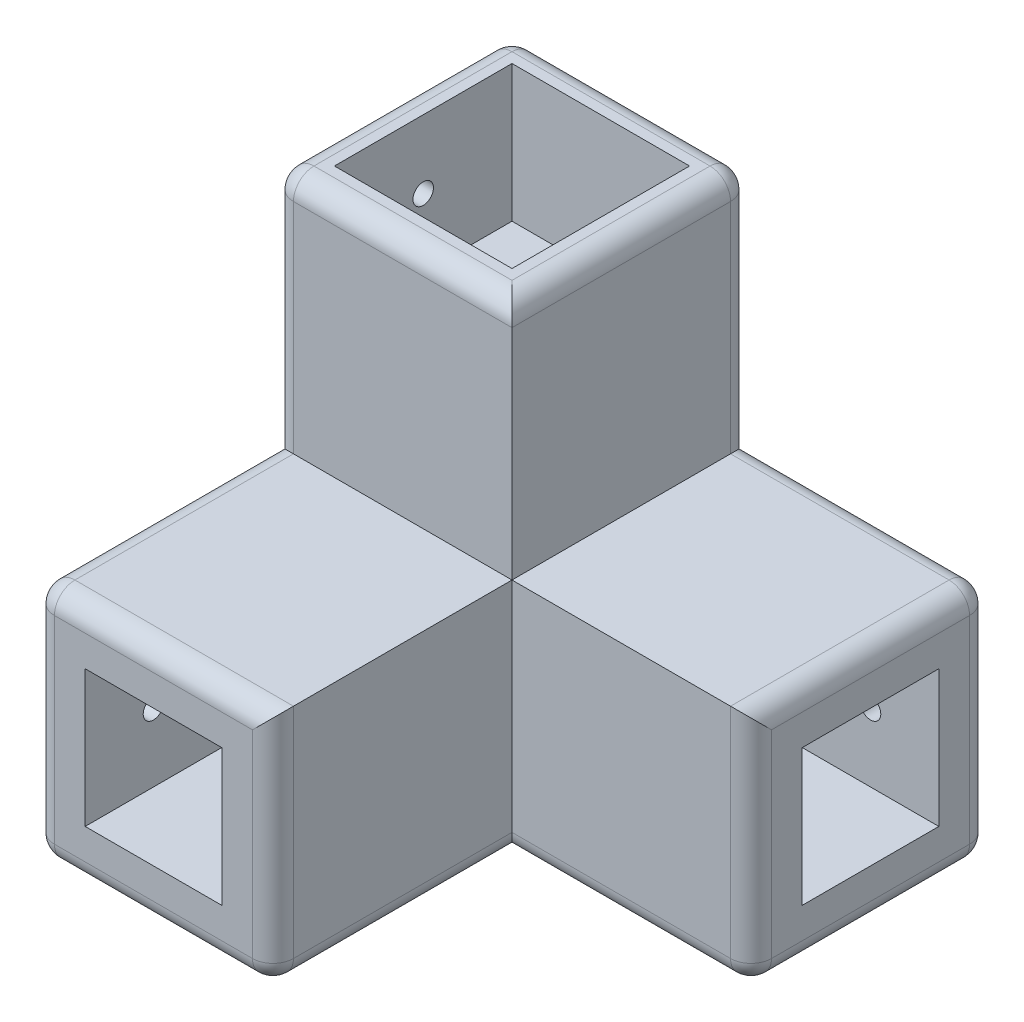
ISO-10303-21;
HEADER;
FILE_DESCRIPTION(('STEP AP214'),'2;1');
FILE_NAME('part.step','',(''),(''),'','','');
FILE_SCHEMA(('AUTOMOTIVE_DESIGN { 1 0 10303 214 1 1 1 1 }'));
ENDSEC;
DATA;
#1=APPLICATION_CONTEXT('core data for automotive mechanical design processes');
#2=APPLICATION_PROTOCOL_DEFINITION('international standard','automotive_design',2000,#1);
#3=PRODUCT_CONTEXT('',#1,'mechanical');
#4=PRODUCT('Part','Part','',(#3));
#5=PRODUCT_RELATED_PRODUCT_CATEGORY('part','',(#4));
#6=PRODUCT_DEFINITION_FORMATION('','',#4);
#7=PRODUCT_DEFINITION_CONTEXT('part definition',#1,'design');
#8=PRODUCT_DEFINITION('design','',#6,#7);
#9=PRODUCT_DEFINITION_SHAPE('','',#8);
#10=(LENGTH_UNIT() NAMED_UNIT(*) SI_UNIT(.MILLI.,.METRE.));
#11=(NAMED_UNIT(*) PLANE_ANGLE_UNIT() SI_UNIT($,.RADIAN.));
#12=(NAMED_UNIT(*) SI_UNIT($,.STERADIAN.) SOLID_ANGLE_UNIT());
#13=UNCERTAINTY_MEASURE_WITH_UNIT(LENGTH_MEASURE(1.E-05),#10,'distance_accuracy_value','');
#14=(GEOMETRIC_REPRESENTATION_CONTEXT(3) GLOBAL_UNCERTAINTY_ASSIGNED_CONTEXT((#13)) GLOBAL_UNIT_ASSIGNED_CONTEXT((#10,
#11,#12)) REPRESENTATION_CONTEXT('',''));
#15=CARTESIAN_POINT('',(0.,0.,0.));
#16=DIRECTION('',(0.,0.,1.));
#17=DIRECTION('',(1.,0.,0.));
#18=AXIS2_PLACEMENT_3D('',#15,#16,#17);
#19=CARTESIAN_POINT('',(0.,0.,35.));
#20=DIRECTION('',(0.,0.,1.));
#21=DIRECTION('',(1.,0.,0.));
#22=AXIS2_PLACEMENT_3D('',#19,#20,#21);
#23=PLANE('',#22);
#24=DIRECTION('',(0.,1.,0.));
#25=VECTOR('',#24,1.);
#26=CARTESIAN_POINT('',(35.,0.,35.));
#27=LINE('',#26,#25);
#28=CARTESIAN_POINT('',(35.,3.,35.));
#29=VERTEX_POINT('',#28);
#30=CARTESIAN_POINT('',(35.,35.,35.));
#31=VERTEX_POINT('',#30);
#32=EDGE_CURVE('E359',#29,#31,#27,.T.);
#33=ORIENTED_EDGE('',*,*,#32,.F.);
#34=DIRECTION('',(1.,0.,0.));
#35=VECTOR('',#34,1.);
#36=CARTESIAN_POINT('',(70.,3.,35.));
#37=LINE('',#36,#35);
#38=CARTESIAN_POINT('',(67.,3.,35.));
#39=VERTEX_POINT('',#38);
#40=EDGE_CURVE('E405',#29,#39,#37,.T.);
#41=ORIENTED_EDGE('',*,*,#40,.T.);
#42=DIRECTION('',(0.,1.,0.));
#43=VECTOR('',#42,1.);
#44=CARTESIAN_POINT('',(67.,35.,35.));
#45=LINE('',#44,#43);
#46=CARTESIAN_POINT('',(67.,35.,35.));
#47=VERTEX_POINT('',#46);
#48=EDGE_CURVE('E403',#39,#47,#45,.T.);
#49=ORIENTED_EDGE('',*,*,#48,.T.);
#50=DIRECTION('',(-1.,0.,0.));
#51=VECTOR('',#50,1.);
#52=CARTESIAN_POINT('',(70.,35.,35.));
#53=LINE('',#52,#51);
#54=EDGE_CURVE('E372',#47,#31,#53,.T.);
#55=ORIENTED_EDGE('',*,*,#54,.T.);
#56=EDGE_LOOP('',(#33,#41,#49,#55));
#57=FACE_BOUND('',#56,.T.);
#58=ADVANCED_FACE('F40',(#57),#23,.T.);
#59=CARTESIAN_POINT('',(35.,70.,35.));
#60=DIRECTION('',(0.,-1.,0.));
#61=DIRECTION('',(1.,0.,0.));
#62=AXIS2_PLACEMENT_3D('',#59,#60,#61);
#63=PLANE('',#62);
#64=DIRECTION('',(0.,0.,-1.));
#65=VECTOR('',#64,1.);
#66=CARTESIAN_POINT('',(32.,70.,35.));
#67=LINE('',#66,#65);
#68=CARTESIAN_POINT('',(32.,70.,32.));
#69=VERTEX_POINT('',#68);
#70=CARTESIAN_POINT('',(32.,70.,3.));
#71=VERTEX_POINT('',#70);
#72=EDGE_CURVE('E63',#69,#71,#67,.T.);
#73=ORIENTED_EDGE('',*,*,#72,.T.);
#74=DIRECTION('',(-1.,0.,0.));
#75=VECTOR('',#74,1.);
#76=CARTESIAN_POINT('',(35.,70.,3.));
#77=LINE('',#76,#75);
#78=CARTESIAN_POINT('',(3.,70.,3.));
#79=VERTEX_POINT('',#78);
#80=EDGE_CURVE('E464',#71,#79,#77,.T.);
#81=ORIENTED_EDGE('',*,*,#80,.T.);
#82=DIRECTION('',(0.,0.,-1.));
#83=VECTOR('',#82,1.);
#84=CARTESIAN_POINT('',(3.,70.,35.));
#85=LINE('',#84,#83);
#86=CARTESIAN_POINT('',(3.,70.,32.));
#87=VERTEX_POINT('',#86);
#88=EDGE_CURVE('E459',#79,#87,#85,.F.);
#89=ORIENTED_EDGE('',*,*,#88,.T.);
#90=DIRECTION('',(-1.,0.,0.));
#91=VECTOR('',#90,1.);
#92=CARTESIAN_POINT('',(35.,70.,32.));
#93=LINE('',#92,#91);
#94=EDGE_CURVE('E461',#87,#69,#93,.F.);
#95=ORIENTED_EDGE('',*,*,#94,.T.);
#96=EDGE_LOOP('',(#73,#81,#89,#95));
#97=FACE_BOUND('',#96,.T.);
#98=DIRECTION('',(1.,0.,0.));
#99=VECTOR('',#98,1.);
#100=CARTESIAN_POINT('',(4.49999999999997,70.,30.5));
#101=LINE('',#100,#99);
#102=CARTESIAN_POINT('',(4.49999999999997,70.,30.5));
#103=VERTEX_POINT('',#102);
#104=CARTESIAN_POINT('',(30.5,70.,30.5));
#105=VERTEX_POINT('',#104);
#106=EDGE_CURVE('E295',#103,#105,#101,.T.);
#107=ORIENTED_EDGE('',*,*,#106,.F.);
#108=DIRECTION('',(0.,0.,1.));
#109=VECTOR('',#108,1.);
#110=CARTESIAN_POINT('',(4.49999999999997,70.,4.5));
#111=LINE('',#110,#109);
#112=CARTESIAN_POINT('',(4.49999999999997,70.,4.5));
#113=VERTEX_POINT('',#112);
#114=EDGE_CURVE('E266',#113,#103,#111,.T.);
#115=ORIENTED_EDGE('',*,*,#114,.F.);
#116=DIRECTION('',(1.,0.,0.));
#117=VECTOR('',#116,1.);
#118=CARTESIAN_POINT('',(4.49999999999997,70.,4.5));
#119=LINE('',#118,#117);
#120=CARTESIAN_POINT('',(30.5,70.,4.5));
#121=VERTEX_POINT('',#120);
#122=EDGE_CURVE('E283',#113,#121,#119,.T.);
#123=ORIENTED_EDGE('',*,*,#122,.T.);
#124=DIRECTION('',(0.,0.,1.));
#125=VECTOR('',#124,1.);
#126=CARTESIAN_POINT('',(30.5,70.,4.5));
#127=LINE('',#126,#125);
#128=EDGE_CURVE('E286',#121,#105,#127,.T.);
#129=ORIENTED_EDGE('',*,*,#128,.T.);
#130=EDGE_LOOP('',(#107,#115,#123,#129));
#131=FACE_BOUND('',#130,.T.);
#132=ADVANCED_FACE('F595',(#97,#131),#63,.F.);
#133=CARTESIAN_POINT('',(0.,70.,35.));
#134=DIRECTION('',(1.,0.,0.));
#135=DIRECTION('',(0.,1.,0.));
#136=AXIS2_PLACEMENT_3D('',#133,#134,#135);
#137=PLANE('',#136);
#138=CARTESIAN_POINT('',(0.,17.5,60.));
#139=DIRECTION('',(-1.,0.,0.));
#140=DIRECTION('',(0.,-1.,0.));
#141=AXIS2_PLACEMENT_3D('',#138,#139,#140);
#142=CIRCLE('',#141,1.5);
#143=CARTESIAN_POINT('',(0.,16.,60.));
#144=VERTEX_POINT('',#143);
#145=EDGE_CURVE('E571',#144,#144,#142,.T.);
#146=ORIENTED_EDGE('',*,*,#145,.F.);
#147=EDGE_LOOP('',(#146));
#148=FACE_BOUND('',#147,.T.);
#149=CARTESIAN_POINT('',(0.,60.,17.5));
#150=DIRECTION('',(-1.,0.,0.));
#151=DIRECTION('',(0.,-1.,0.));
#152=AXIS2_PLACEMENT_3D('',#149,#150,#151);
#153=CIRCLE('',#152,1.5);
#154=CARTESIAN_POINT('',(0.,58.5,17.5));
#155=VERTEX_POINT('',#154);
#156=EDGE_CURVE('E289',#155,#155,#153,.T.);
#157=ORIENTED_EDGE('',*,*,#156,.F.);
#158=EDGE_LOOP('',(#157));
#159=FACE_BOUND('',#158,.T.);
#160=DIRECTION('',(0.,0.,-1.));
#161=VECTOR('',#160,1.);
#162=CARTESIAN_POINT('',(0.,3.,35.));
#163=LINE('',#162,#161);
#164=CARTESIAN_POINT('',(0.,3.,3.));
#165=VERTEX_POINT('',#164);
#166=CARTESIAN_POINT('',(0.,3.,67.));
#167=VERTEX_POINT('',#166);
#168=EDGE_CURVE('E429',#165,#167,#163,.F.);
#169=ORIENTED_EDGE('',*,*,#168,.T.);
#170=DIRECTION('',(0.,-1.,0.));
#171=VECTOR('',#170,1.);
#172=CARTESIAN_POINT('',(0.,35.,67.));
#173=LINE('',#172,#171);
#174=CARTESIAN_POINT('',(0.,32.,67.));
#175=VERTEX_POINT('',#174);
#176=EDGE_CURVE('E436',#167,#175,#173,.F.);
#177=ORIENTED_EDGE('',*,*,#176,.T.);
#178=DIRECTION('',(0.,0.,-1.));
#179=VECTOR('',#178,1.);
#180=CARTESIAN_POINT('',(0.,32.,35.));
#181=LINE('',#180,#179);
#182=CARTESIAN_POINT('',(0.,32.,32.));
#183=VERTEX_POINT('',#182);
#184=EDGE_CURVE('E434',#175,#183,#181,.T.);
#185=ORIENTED_EDGE('',*,*,#184,.T.);
#186=DIRECTION('',(0.,-1.,0.));
#187=VECTOR('',#186,1.);
#188=CARTESIAN_POINT('',(0.,70.,32.));
#189=LINE('',#188,#187);
#190=CARTESIAN_POINT('',(0.,67.,32.));
#191=VERTEX_POINT('',#190);
#192=EDGE_CURVE('E431',#183,#191,#189,.F.);
#193=ORIENTED_EDGE('',*,*,#192,.T.);
#194=DIRECTION('',(0.,0.,-1.));
#195=VECTOR('',#194,1.);
#196=CARTESIAN_POINT('',(0.,67.,35.));
#197=LINE('',#196,#195);
#198=CARTESIAN_POINT('',(0.,67.,3.));
#199=VERTEX_POINT('',#198);
#200=EDGE_CURVE('E427',#191,#199,#197,.T.);
#201=ORIENTED_EDGE('',*,*,#200,.T.);
#202=DIRECTION('',(0.,-1.,0.));
#203=VECTOR('',#202,1.);
#204=CARTESIAN_POINT('',(0.,70.,3.));
#205=LINE('',#204,#203);
#206=EDGE_CURVE('E425',#199,#165,#205,.T.);
#207=ORIENTED_EDGE('',*,*,#206,.T.);
#208=EDGE_LOOP('',(#169,#177,#185,#193,#201,#207));
#209=FACE_BOUND('',#208,.T.);
#210=ADVANCED_FACE('F602',(#148,#159,#209),#137,.F.);
#211=CARTESIAN_POINT('',(0.,0.,35.));
#212=DIRECTION('',(0.,1.,0.));
#213=DIRECTION('',(0.,0.,1.));
#214=AXIS2_PLACEMENT_3D('',#211,#212,#213);
#215=PLANE('',#214);
#216=DIRECTION('',(1.,0.,0.));
#217=VECTOR('',#216,1.);
#218=CARTESIAN_POINT('',(0.,0.,3.));
#219=LINE('',#218,#217);
#220=CARTESIAN_POINT('',(3.,0.,3.));
#221=VERTEX_POINT('',#220);
#222=CARTESIAN_POINT('',(67.,0.,3.));
#223=VERTEX_POINT('',#222);
#224=EDGE_CURVE('E392',#221,#223,#219,.T.);
#225=ORIENTED_EDGE('',*,*,#224,.T.);
#226=DIRECTION('',(0.,0.,-1.));
#227=VECTOR('',#226,1.);
#228=CARTESIAN_POINT('',(67.,0.,35.));
#229=LINE('',#228,#227);
#230=CARTESIAN_POINT('',(67.,0.,32.));
#231=VERTEX_POINT('',#230);
#232=EDGE_CURVE('E400',#223,#231,#229,.F.);
#233=ORIENTED_EDGE('',*,*,#232,.T.);
#234=DIRECTION('',(1.,0.,0.));
#235=VECTOR('',#234,1.);
#236=CARTESIAN_POINT('',(35.,0.,32.));
#237=LINE('',#236,#235);
#238=CARTESIAN_POINT('',(32.,0.,32.));
#239=VERTEX_POINT('',#238);
#240=EDGE_CURVE('E398',#231,#239,#237,.F.);
#241=ORIENTED_EDGE('',*,*,#240,.T.);
#242=DIRECTION('',(0.,0.,-1.));
#243=VECTOR('',#242,1.);
#244=CARTESIAN_POINT('',(32.,0.,35.));
#245=LINE('',#244,#243);
#246=CARTESIAN_POINT('',(32.,0.,67.));
#247=VERTEX_POINT('',#246);
#248=EDGE_CURVE('E396',#239,#247,#245,.F.);
#249=ORIENTED_EDGE('',*,*,#248,.T.);
#250=DIRECTION('',(1.,0.,0.));
#251=VECTOR('',#250,1.);
#252=CARTESIAN_POINT('',(0.,0.,67.));
#253=LINE('',#252,#251);
#254=CARTESIAN_POINT('',(3.,0.,67.));
#255=VERTEX_POINT('',#254);
#256=EDGE_CURVE('E394',#247,#255,#253,.F.);
#257=ORIENTED_EDGE('',*,*,#256,.T.);
#258=DIRECTION('',(0.,0.,-1.));
#259=VECTOR('',#258,1.);
#260=CARTESIAN_POINT('',(3.,0.,35.));
#261=LINE('',#260,#259);
#262=EDGE_CURVE('E390',#255,#221,#261,.T.);
#263=ORIENTED_EDGE('',*,*,#262,.T.);
#264=EDGE_LOOP('',(#225,#233,#241,#249,#257,#263));
#265=FACE_BOUND('',#264,.T.);
#266=ADVANCED_FACE('F858',(#265),#215,.F.);
#267=CARTESIAN_POINT('',(70.,0.,35.));
#268=DIRECTION('',(-1.,0.,0.));
#269=DIRECTION('',(0.,0.,1.));
#270=AXIS2_PLACEMENT_3D('',#267,#268,#269);
#271=PLANE('',#270);
#272=DIRECTION('',(0.,1.,0.));
#273=VECTOR('',#272,1.);
#274=CARTESIAN_POINT('',(70.,0.,32.));
#275=LINE('',#274,#273);
#276=CARTESIAN_POINT('',(70.,32.,32.));
#277=VERTEX_POINT('',#276);
#278=CARTESIAN_POINT('',(70.,3.,32.));
#279=VERTEX_POINT('',#278);
#280=EDGE_CURVE('E385',#277,#279,#275,.F.);
#281=ORIENTED_EDGE('',*,*,#280,.T.);
#282=DIRECTION('',(0.,0.,-1.));
#283=VECTOR('',#282,1.);
#284=CARTESIAN_POINT('',(70.,3.,35.));
#285=LINE('',#284,#283);
#286=CARTESIAN_POINT('',(70.,3.,3.));
#287=VERTEX_POINT('',#286);
#288=EDGE_CURVE('E387',#279,#287,#285,.T.);
#289=ORIENTED_EDGE('',*,*,#288,.T.);
#290=DIRECTION('',(0.,1.,0.));
#291=VECTOR('',#290,1.);
#292=CARTESIAN_POINT('',(70.,0.,3.));
#293=LINE('',#292,#291);
#294=CARTESIAN_POINT('',(70.,32.,3.));
#295=VERTEX_POINT('',#294);
#296=EDGE_CURVE('E381',#287,#295,#293,.T.);
#297=ORIENTED_EDGE('',*,*,#296,.T.);
#298=DIRECTION('',(0.,0.,-1.));
#299=VECTOR('',#298,1.);
#300=CARTESIAN_POINT('',(70.,32.,35.));
#301=LINE('',#300,#299);
#302=EDGE_CURVE('E383',#295,#277,#301,.F.);
#303=ORIENTED_EDGE('',*,*,#302,.T.);
#304=EDGE_LOOP('',(#281,#289,#297,#303));
#305=FACE_BOUND('',#304,.T.);
#306=DIRECTION('',(0.,0.,-1.));
#307=VECTOR('',#306,1.);
#308=CARTESIAN_POINT('',(70.,7.5,27.5));
#309=LINE('',#308,#307);
#310=CARTESIAN_POINT('',(70.,7.5,27.5));
#311=VERTEX_POINT('',#310);
#312=CARTESIAN_POINT('',(70.,7.5,7.5));
#313=VERTEX_POINT('',#312);
#314=EDGE_CURVE('E319',#311,#313,#309,.T.);
#315=ORIENTED_EDGE('',*,*,#314,.F.);
#316=DIRECTION('',(0.,-1.,0.));
#317=VECTOR('',#316,1.);
#318=CARTESIAN_POINT('',(70.,27.5,27.5));
#319=LINE('',#318,#317);
#320=CARTESIAN_POINT('',(70.,27.5,27.5));
#321=VERTEX_POINT('',#320);
#322=EDGE_CURVE('E302',#321,#311,#319,.T.);
#323=ORIENTED_EDGE('',*,*,#322,.F.);
#324=DIRECTION('',(0.,0.,-1.));
#325=VECTOR('',#324,1.);
#326=CARTESIAN_POINT('',(70.,27.5,27.5));
#327=LINE('',#326,#325);
#328=CARTESIAN_POINT('',(70.,27.5,7.50000000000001));
#329=VERTEX_POINT('',#328);
#330=EDGE_CURVE('E310',#321,#329,#327,.T.);
#331=ORIENTED_EDGE('',*,*,#330,.T.);
#332=DIRECTION('',(0.,-1.,0.));
#333=VECTOR('',#332,1.);
#334=CARTESIAN_POINT('',(70.,27.5,7.50000000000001));
#335=LINE('',#334,#333);
#336=EDGE_CURVE('E322',#329,#313,#335,.T.);
#337=ORIENTED_EDGE('',*,*,#336,.T.);
#338=EDGE_LOOP('',(#315,#323,#331,#337));
#339=FACE_BOUND('',#338,.T.);
#340=ADVANCED_FACE('F872',(#305,#339),#271,.F.);
#341=CARTESIAN_POINT('',(70.,35.,35.));
#342=DIRECTION('',(0.,-1.,0.));
#343=DIRECTION('',(0.,0.,-1.));
#344=AXIS2_PLACEMENT_3D('',#341,#342,#343);
#345=PLANE('',#344);
#346=ORIENTED_EDGE('',*,*,#54,.F.);
#347=DIRECTION('',(0.,0.,-1.));
#348=VECTOR('',#347,1.);
#349=CARTESIAN_POINT('',(67.,35.,35.));
#350=LINE('',#349,#348);
#351=CARTESIAN_POINT('',(67.,35.,3.));
#352=VERTEX_POINT('',#351);
#353=EDGE_CURVE('E440',#47,#352,#350,.T.);
#354=ORIENTED_EDGE('',*,*,#353,.T.);
#355=DIRECTION('',(-1.,0.,0.));
#356=VECTOR('',#355,1.);
#357=CARTESIAN_POINT('',(70.,35.,3.));
#358=LINE('',#357,#356);
#359=CARTESIAN_POINT('',(35.,35.,3.));
#360=VERTEX_POINT('',#359);
#361=EDGE_CURVE('E438',#352,#360,#358,.T.);
#362=ORIENTED_EDGE('',*,*,#361,.T.);
#363=DIRECTION('',(0.,0.,-1.));
#364=VECTOR('',#363,1.);
#365=CARTESIAN_POINT('',(35.,35.,35.));
#366=LINE('',#365,#364);
#367=EDGE_CURVE('E378',#31,#360,#366,.T.);
#368=ORIENTED_EDGE('',*,*,#367,.F.);
#369=EDGE_LOOP('',(#346,#354,#362,#368));
#370=FACE_BOUND('',#369,.T.);
#371=ADVANCED_FACE('F617',(#370),#345,.F.);
#372=CARTESIAN_POINT('',(35.,35.,35.));
#373=DIRECTION('',(-1.,0.,0.));
#374=DIRECTION('',(0.,0.,1.));
#375=AXIS2_PLACEMENT_3D('',#372,#373,#374);
#376=PLANE('',#375);
#377=ORIENTED_EDGE('',*,*,#367,.T.);
#378=DIRECTION('',(0.,1.,0.));
#379=VECTOR('',#378,1.);
#380=CARTESIAN_POINT('',(35.,35.,3.));
#381=LINE('',#380,#379);
#382=CARTESIAN_POINT('',(35.,67.,3.));
#383=VERTEX_POINT('',#382);
#384=EDGE_CURVE('E457',#360,#383,#381,.T.);
#385=ORIENTED_EDGE('',*,*,#384,.T.);
#386=DIRECTION('',(0.,0.,-1.));
#387=VECTOR('',#386,1.);
#388=CARTESIAN_POINT('',(35.,67.,35.));
#389=LINE('',#388,#387);
#390=CARTESIAN_POINT('',(35.,67.,35.));
#391=VERTEX_POINT('',#390);
#392=EDGE_CURVE('E455',#383,#391,#389,.F.);
#393=ORIENTED_EDGE('',*,*,#392,.T.);
#394=DIRECTION('',(0.,1.,0.));
#395=VECTOR('',#394,1.);
#396=CARTESIAN_POINT('',(35.,35.,35.));
#397=LINE('',#396,#395);
#398=EDGE_CURVE('E375',#31,#391,#397,.T.);
#399=ORIENTED_EDGE('',*,*,#398,.F.);
#400=EDGE_LOOP('',(#377,#385,#393,#399));
#401=FACE_BOUND('',#400,.T.);
#402=ADVANCED_FACE('F609',(#401),#376,.F.);
#403=DIRECTION('',(-1.,0.,0.));
#404=VECTOR('',#403,1.);
#405=CARTESIAN_POINT('',(0.,67.,35.));
#406=LINE('',#405,#404);
#407=CARTESIAN_POINT('',(3.,67.,35.));
#408=VERTEX_POINT('',#407);
#409=EDGE_CURVE('E421',#391,#408,#406,.T.);
#410=ORIENTED_EDGE('',*,*,#409,.T.);
#411=DIRECTION('',(0.,-1.,0.));
#412=VECTOR('',#411,1.);
#413=CARTESIAN_POINT('',(3.,35.,35.));
#414=LINE('',#413,#412);
#415=CARTESIAN_POINT('',(3.,35.,35.));
#416=VERTEX_POINT('',#415);
#417=EDGE_CURVE('E423',#408,#416,#414,.T.);
#418=ORIENTED_EDGE('',*,*,#417,.T.);
#419=DIRECTION('',(-1.,0.,0.));
#420=VECTOR('',#419,1.);
#421=CARTESIAN_POINT('',(35.,35.,35.));
#422=LINE('',#421,#420);
#423=EDGE_CURVE('E368',#31,#416,#422,.T.);
#424=ORIENTED_EDGE('',*,*,#423,.F.);
#425=ORIENTED_EDGE('',*,*,#398,.T.);
#426=EDGE_LOOP('',(#410,#418,#424,#425));
#427=FACE_BOUND('',#426,.T.);
#428=ADVANCED_FACE('F598',(#427),#23,.T.);
#429=CARTESIAN_POINT('',(0.,0.,0.));
#430=DIRECTION('',(0.,0.,1.));
#431=DIRECTION('',(1.,0.,0.));
#432=AXIS2_PLACEMENT_3D('',#429,#430,#431);
#433=PLANE('',#432);
#434=CARTESIAN_POINT('',(60.,17.5,0.));
#435=DIRECTION('',(0.,0.,-1.));
#436=DIRECTION('',(-1.,0.,0.));
#437=AXIS2_PLACEMENT_3D('',#434,#435,#436);
#438=CIRCLE('',#437,1.5);
#439=CARTESIAN_POINT('',(58.5,17.5,0.));
#440=VERTEX_POINT('',#439);
#441=EDGE_CURVE('E1416',#440,#440,#438,.T.);
#442=ORIENTED_EDGE('',*,*,#441,.F.);
#443=EDGE_LOOP('',(#442));
#444=FACE_BOUND('',#443,.T.);
#445=DIRECTION('',(0.,1.,0.));
#446=VECTOR('',#445,1.);
#447=CARTESIAN_POINT('',(67.,0.,0.));
#448=LINE('',#447,#446);
#449=CARTESIAN_POINT('',(67.,32.,0.));
#450=VERTEX_POINT('',#449);
#451=CARTESIAN_POINT('',(67.,3.,0.));
#452=VERTEX_POINT('',#451);
#453=EDGE_CURVE('E450',#450,#452,#448,.F.);
#454=ORIENTED_EDGE('',*,*,#453,.T.);
#455=DIRECTION('',(1.,0.,0.));
#456=VECTOR('',#455,1.);
#457=CARTESIAN_POINT('',(0.,3.,0.));
#458=LINE('',#457,#456);
#459=CARTESIAN_POINT('',(3.,3.,0.));
#460=VERTEX_POINT('',#459);
#461=EDGE_CURVE('E452',#452,#460,#458,.F.);
#462=ORIENTED_EDGE('',*,*,#461,.T.);
#463=DIRECTION('',(0.,-1.,0.));
#464=VECTOR('',#463,1.);
#465=CARTESIAN_POINT('',(3.,0.,0.));
#466=LINE('',#465,#464);
#467=CARTESIAN_POINT('',(3.,67.,0.));
#468=VERTEX_POINT('',#467);
#469=EDGE_CURVE('E442',#460,#468,#466,.F.);
#470=ORIENTED_EDGE('',*,*,#469,.T.);
#471=DIRECTION('',(-1.,0.,0.));
#472=VECTOR('',#471,1.);
#473=CARTESIAN_POINT('',(0.,67.,0.));
#474=LINE('',#473,#472);
#475=CARTESIAN_POINT('',(32.,67.,0.));
#476=VERTEX_POINT('',#475);
#477=EDGE_CURVE('E444',#468,#476,#474,.F.);
#478=ORIENTED_EDGE('',*,*,#477,.T.);
#479=DIRECTION('',(0.,1.,0.));
#480=VECTOR('',#479,1.);
#481=CARTESIAN_POINT('',(32.,0.,0.));
#482=LINE('',#481,#480);
#483=CARTESIAN_POINT('',(32.,32.,0.));
#484=VERTEX_POINT('',#483);
#485=EDGE_CURVE('E446',#476,#484,#482,.F.);
#486=ORIENTED_EDGE('',*,*,#485,.T.);
#487=DIRECTION('',(-1.,0.,0.));
#488=VECTOR('',#487,1.);
#489=CARTESIAN_POINT('',(0.,32.,0.));
#490=LINE('',#489,#488);
#491=EDGE_CURVE('E448',#484,#450,#490,.F.);
#492=ORIENTED_EDGE('',*,*,#491,.T.);
#493=EDGE_LOOP('',(#454,#462,#470,#478,#486,#492));
#494=FACE_BOUND('',#493,.T.);
#495=ADVANCED_FACE('F608',(#444,#494),#433,.F.);
#496=CARTESIAN_POINT('',(35.,0.,70.));
#497=DIRECTION('',(-1.,0.,0.));
#498=DIRECTION('',(0.,0.,1.));
#499=AXIS2_PLACEMENT_3D('',#496,#497,#498);
#500=PLANE('',#499);
#501=DIRECTION('',(0.,1.,0.));
#502=VECTOR('',#501,1.);
#503=CARTESIAN_POINT('',(35.,0.,67.));
#504=LINE('',#503,#502);
#505=CARTESIAN_POINT('',(35.,35.,67.));
#506=VERTEX_POINT('',#505);
#507=CARTESIAN_POINT('',(35.,3.,67.));
#508=VERTEX_POINT('',#507);
#509=EDGE_CURVE('E408',#506,#508,#504,.F.);
#510=ORIENTED_EDGE('',*,*,#509,.T.);
#511=DIRECTION('',(0.,0.,-1.));
#512=VECTOR('',#511,1.);
#513=CARTESIAN_POINT('',(35.,3.,70.));
#514=LINE('',#513,#512);
#515=EDGE_CURVE('E410',#508,#29,#514,.T.);
#516=ORIENTED_EDGE('',*,*,#515,.T.);
#517=ORIENTED_EDGE('',*,*,#32,.T.);
#518=DIRECTION('',(0.,0.,-1.));
#519=VECTOR('',#518,1.);
#520=CARTESIAN_POINT('',(35.,35.,70.));
#521=LINE('',#520,#519);
#522=EDGE_CURVE('E370',#506,#31,#521,.T.);
#523=ORIENTED_EDGE('',*,*,#522,.F.);
#524=EDGE_LOOP('',(#510,#516,#517,#523));
#525=FACE_BOUND('',#524,.T.);
#526=ADVANCED_FACE('F615',(#525),#500,.F.);
#527=CARTESIAN_POINT('',(35.,35.,70.));
#528=DIRECTION('',(0.,-1.,0.));
#529=DIRECTION('',(0.,0.,-1.));
#530=AXIS2_PLACEMENT_3D('',#527,#528,#529);
#531=PLANE('',#530);
#532=DIRECTION('',(0.,0.,-1.));
#533=VECTOR('',#532,1.);
#534=CARTESIAN_POINT('',(3.,35.,70.));
#535=LINE('',#534,#533);
#536=CARTESIAN_POINT('',(3.,35.,67.));
#537=VERTEX_POINT('',#536);
#538=EDGE_CURVE('E49',#416,#537,#535,.F.);
#539=ORIENTED_EDGE('',*,*,#538,.T.);
#540=DIRECTION('',(-1.,0.,0.));
#541=VECTOR('',#540,1.);
#542=CARTESIAN_POINT('',(35.,35.,67.));
#543=LINE('',#542,#541);
#544=EDGE_CURVE('E11',#537,#506,#543,.F.);
#545=ORIENTED_EDGE('',*,*,#544,.T.);
#546=ORIENTED_EDGE('',*,*,#522,.T.);
#547=ORIENTED_EDGE('',*,*,#423,.T.);
#548=EDGE_LOOP('',(#539,#545,#546,#547));
#549=FACE_BOUND('',#548,.T.);
#550=ADVANCED_FACE('F659',(#549),#531,.F.);
#551=CARTESIAN_POINT('',(0.,0.,70.));
#552=DIRECTION('',(0.,0.,1.));
#553=DIRECTION('',(1.,0.,0.));
#554=AXIS2_PLACEMENT_3D('',#551,#552,#553);
#555=PLANE('',#554);
#556=DIRECTION('',(0.,-1.,0.));
#557=VECTOR('',#556,1.);
#558=CARTESIAN_POINT('',(3.,0.,70.));
#559=LINE('',#558,#557);
#560=CARTESIAN_POINT('',(3.,32.,70.));
#561=VERTEX_POINT('',#560);
#562=CARTESIAN_POINT('',(3.,3.,70.));
#563=VERTEX_POINT('',#562);
#564=EDGE_CURVE('E412',#561,#563,#559,.T.);
#565=ORIENTED_EDGE('',*,*,#564,.T.);
#566=DIRECTION('',(1.,0.,0.));
#567=VECTOR('',#566,1.);
#568=CARTESIAN_POINT('',(35.,3.,70.));
#569=LINE('',#568,#567);
#570=CARTESIAN_POINT('',(32.,3.,70.));
#571=VERTEX_POINT('',#570);
#572=EDGE_CURVE('E418',#563,#571,#569,.T.);
#573=ORIENTED_EDGE('',*,*,#572,.T.);
#574=DIRECTION('',(0.,1.,0.));
#575=VECTOR('',#574,1.);
#576=CARTESIAN_POINT('',(32.,35.,70.));
#577=LINE('',#576,#575);
#578=CARTESIAN_POINT('',(32.,32.,70.));
#579=VERTEX_POINT('',#578);
#580=EDGE_CURVE('E416',#571,#579,#577,.T.);
#581=ORIENTED_EDGE('',*,*,#580,.T.);
#582=DIRECTION('',(-1.,0.,0.));
#583=VECTOR('',#582,1.);
#584=CARTESIAN_POINT('',(0.,32.,70.));
#585=LINE('',#584,#583);
#586=EDGE_CURVE('E414',#579,#561,#585,.T.);
#587=ORIENTED_EDGE('',*,*,#586,.T.);
#588=EDGE_LOOP('',(#565,#573,#581,#587));
#589=FACE_BOUND('',#588,.T.);
#590=DIRECTION('',(0.,-1.,0.));
#591=VECTOR('',#590,1.);
#592=CARTESIAN_POINT('',(7.5,27.5,70.));
#593=LINE('',#592,#591);
#594=CARTESIAN_POINT('',(7.5,27.5,70.));
#595=VERTEX_POINT('',#594);
#596=CARTESIAN_POINT('',(7.5,7.5,70.));
#597=VERTEX_POINT('',#596);
#598=EDGE_CURVE('E329',#595,#597,#593,.T.);
#599=ORIENTED_EDGE('',*,*,#598,.F.);
#600=DIRECTION('',(1.,0.,0.));
#601=VECTOR('',#600,1.);
#602=CARTESIAN_POINT('',(7.5,27.5,70.));
#603=LINE('',#602,#601);
#604=CARTESIAN_POINT('',(27.5,27.5,70.));
#605=VERTEX_POINT('',#604);
#606=EDGE_CURVE('E340',#595,#605,#603,.T.);
#607=ORIENTED_EDGE('',*,*,#606,.T.);
#608=DIRECTION('',(0.,-1.,0.));
#609=VECTOR('',#608,1.);
#610=CARTESIAN_POINT('',(27.5,27.5,70.));
#611=LINE('',#610,#609);
#612=CARTESIAN_POINT('',(27.5,7.5,70.));
#613=VERTEX_POINT('',#612);
#614=EDGE_CURVE('E352',#605,#613,#611,.T.);
#615=ORIENTED_EDGE('',*,*,#614,.T.);
#616=DIRECTION('',(1.,0.,0.));
#617=VECTOR('',#616,1.);
#618=CARTESIAN_POINT('',(7.5,7.5,70.));
#619=LINE('',#618,#617);
#620=EDGE_CURVE('E349',#597,#613,#619,.T.);
#621=ORIENTED_EDGE('',*,*,#620,.F.);
#622=EDGE_LOOP('',(#599,#607,#615,#621));
#623=FACE_BOUND('',#622,.T.);
#624=ADVANCED_FACE('F749',(#589,#623),#555,.T.);
#625=CARTESIAN_POINT('',(7.5,27.5,50.));
#626=DIRECTION('',(-1.,0.,0.));
#627=DIRECTION('',(0.,-1.,0.));
#628=AXIS2_PLACEMENT_3D('',#625,#626,#627);
#629=PLANE('',#628);
#630=CARTESIAN_POINT('',(7.5,17.5,60.));
#631=DIRECTION('',(-1.,0.,0.));
#632=DIRECTION('',(0.,-1.,0.));
#633=AXIS2_PLACEMENT_3D('',#630,#631,#632);
#634=CIRCLE('',#633,1.5);
#635=CARTESIAN_POINT('',(7.5,16.,60.));
#636=VERTEX_POINT('',#635);
#637=EDGE_CURVE('E470',#636,#636,#634,.T.);
#638=ORIENTED_EDGE('',*,*,#637,.T.);
#639=EDGE_LOOP('',(#638));
#640=FACE_BOUND('',#639,.T.);
#641=ORIENTED_EDGE('',*,*,#598,.T.);
#642=DIRECTION('',(0.,0.,1.));
#643=VECTOR('',#642,1.);
#644=CARTESIAN_POINT('',(7.5,7.5,50.));
#645=LINE('',#644,#643);
#646=CARTESIAN_POINT('',(7.5,7.5,50.));
#647=VERTEX_POINT('',#646);
#648=EDGE_CURVE('E347',#647,#597,#645,.T.);
#649=ORIENTED_EDGE('',*,*,#648,.F.);
#650=DIRECTION('',(0.,-1.,0.));
#651=VECTOR('',#650,1.);
#652=CARTESIAN_POINT('',(7.5,27.5,50.));
#653=LINE('',#652,#651);
#654=CARTESIAN_POINT('',(7.5,27.5,50.));
#655=VERTEX_POINT('',#654);
#656=EDGE_CURVE('E336',#655,#647,#653,.T.);
#657=ORIENTED_EDGE('',*,*,#656,.F.);
#658=DIRECTION('',(0.,0.,1.));
#659=VECTOR('',#658,1.);
#660=CARTESIAN_POINT('',(7.5,27.5,50.));
#661=LINE('',#660,#659);
#662=EDGE_CURVE('E357',#655,#595,#661,.T.);
#663=ORIENTED_EDGE('',*,*,#662,.T.);
#664=EDGE_LOOP('',(#641,#649,#657,#663));
#665=FACE_BOUND('',#664,.T.);
#666=ADVANCED_FACE('F575',(#640,#665),#629,.F.);
#667=CARTESIAN_POINT('',(7.5,27.5,50.));
#668=DIRECTION('',(0.,-1.,0.));
#669=DIRECTION('',(0.,0.,-1.));
#670=AXIS2_PLACEMENT_3D('',#667,#668,#669);
#671=PLANE('',#670);
#672=ORIENTED_EDGE('',*,*,#606,.F.);
#673=ORIENTED_EDGE('',*,*,#662,.F.);
#674=DIRECTION('',(1.,0.,0.));
#675=VECTOR('',#674,1.);
#676=CARTESIAN_POINT('',(7.5,27.5,50.));
#677=LINE('',#676,#675);
#678=CARTESIAN_POINT('',(27.5,27.5,50.));
#679=VERTEX_POINT('',#678);
#680=EDGE_CURVE('E345',#655,#679,#677,.T.);
#681=ORIENTED_EDGE('',*,*,#680,.T.);
#682=DIRECTION('',(0.,0.,1.));
#683=VECTOR('',#682,1.);
#684=CARTESIAN_POINT('',(27.5,27.5,50.));
#685=LINE('',#684,#683);
#686=EDGE_CURVE('E360',#679,#605,#685,.T.);
#687=ORIENTED_EDGE('',*,*,#686,.T.);
#688=EDGE_LOOP('',(#672,#673,#681,#687));
#689=FACE_BOUND('',#688,.T.);
#690=ADVANCED_FACE('F736',(#689),#671,.T.);
#691=CARTESIAN_POINT('',(27.5,27.5,50.));
#692=DIRECTION('',(-1.,0.,0.));
#693=DIRECTION('',(0.,-1.,0.));
#694=AXIS2_PLACEMENT_3D('',#691,#692,#693);
#695=PLANE('',#694);
#696=ORIENTED_EDGE('',*,*,#614,.F.);
#697=ORIENTED_EDGE('',*,*,#686,.F.);
#698=DIRECTION('',(0.,-1.,0.));
#699=VECTOR('',#698,1.);
#700=CARTESIAN_POINT('',(27.5,27.5,50.));
#701=LINE('',#700,#699);
#702=CARTESIAN_POINT('',(27.5,7.5,50.));
#703=VERTEX_POINT('',#702);
#704=EDGE_CURVE('E343',#679,#703,#701,.T.);
#705=ORIENTED_EDGE('',*,*,#704,.T.);
#706=DIRECTION('',(0.,0.,1.));
#707=VECTOR('',#706,1.);
#708=CARTESIAN_POINT('',(27.5,7.5,50.));
#709=LINE('',#708,#707);
#710=EDGE_CURVE('E362',#703,#613,#709,.T.);
#711=ORIENTED_EDGE('',*,*,#710,.T.);
#712=EDGE_LOOP('',(#696,#697,#705,#711));
#713=FACE_BOUND('',#712,.T.);
#714=ADVANCED_FACE('F739',(#713),#695,.T.);
#715=CARTESIAN_POINT('',(7.5,7.5,50.));
#716=DIRECTION('',(0.,-1.,0.));
#717=DIRECTION('',(0.,0.,-1.));
#718=AXIS2_PLACEMENT_3D('',#715,#716,#717);
#719=PLANE('',#718);
#720=ORIENTED_EDGE('',*,*,#620,.T.);
#721=ORIENTED_EDGE('',*,*,#710,.F.);
#722=DIRECTION('',(1.,0.,0.));
#723=VECTOR('',#722,1.);
#724=CARTESIAN_POINT('',(7.5,7.5,50.));
#725=LINE('',#724,#723);
#726=EDGE_CURVE('E339',#647,#703,#725,.T.);
#727=ORIENTED_EDGE('',*,*,#726,.F.);
#728=ORIENTED_EDGE('',*,*,#648,.T.);
#729=EDGE_LOOP('',(#720,#721,#727,#728));
#730=FACE_BOUND('',#729,.T.);
#731=ADVANCED_FACE('F734',(#730),#719,.F.);
#732=CARTESIAN_POINT('',(0.,0.,50.));
#733=DIRECTION('',(0.,0.,1.));
#734=DIRECTION('',(1.,0.,0.));
#735=AXIS2_PLACEMENT_3D('',#732,#733,#734);
#736=PLANE('',#735);
#737=ORIENTED_EDGE('',*,*,#656,.T.);
#738=ORIENTED_EDGE('',*,*,#726,.T.);
#739=ORIENTED_EDGE('',*,*,#704,.F.);
#740=ORIENTED_EDGE('',*,*,#680,.F.);
#741=EDGE_LOOP('',(#737,#738,#739,#740));
#742=FACE_BOUND('',#741,.T.);
#743=ADVANCED_FACE('F730',(#742),#736,.T.);
#744=CARTESIAN_POINT('',(50.,27.5,27.5));
#745=DIRECTION('',(0.,0.,1.));
#746=DIRECTION('',(0.,-1.,0.));
#747=AXIS2_PLACEMENT_3D('',#744,#745,#746);
#748=PLANE('',#747);
#749=ORIENTED_EDGE('',*,*,#322,.T.);
#750=DIRECTION('',(1.,0.,0.));
#751=VECTOR('',#750,1.);
#752=CARTESIAN_POINT('',(50.,7.5,27.5));
#753=LINE('',#752,#751);
#754=CARTESIAN_POINT('',(50.,7.5,27.5));
#755=VERTEX_POINT('',#754);
#756=EDGE_CURVE('E317',#755,#311,#753,.T.);
#757=ORIENTED_EDGE('',*,*,#756,.F.);
#758=DIRECTION('',(0.,-1.,0.));
#759=VECTOR('',#758,1.);
#760=CARTESIAN_POINT('',(50.,27.5,27.5));
#761=LINE('',#760,#759);
#762=CARTESIAN_POINT('',(50.,27.5,27.5));
#763=VERTEX_POINT('',#762);
#764=EDGE_CURVE('E306',#763,#755,#761,.T.);
#765=ORIENTED_EDGE('',*,*,#764,.F.);
#766=DIRECTION('',(1.,0.,0.));
#767=VECTOR('',#766,1.);
#768=CARTESIAN_POINT('',(50.,27.5,27.5));
#769=LINE('',#768,#767);
#770=EDGE_CURVE('E327',#763,#321,#769,.T.);
#771=ORIENTED_EDGE('',*,*,#770,.T.);
#772=EDGE_LOOP('',(#749,#757,#765,#771));
#773=FACE_BOUND('',#772,.T.);
#774=ADVANCED_FACE('F720',(#773),#748,.F.);
#775=CARTESIAN_POINT('',(50.,27.5,27.5));
#776=DIRECTION('',(0.,-1.,0.));
#777=DIRECTION('',(0.,0.,-1.));
#778=AXIS2_PLACEMENT_3D('',#775,#776,#777);
#779=PLANE('',#778);
#780=ORIENTED_EDGE('',*,*,#330,.F.);
#781=ORIENTED_EDGE('',*,*,#770,.F.);
#782=DIRECTION('',(0.,0.,-1.));
#783=VECTOR('',#782,1.);
#784=CARTESIAN_POINT('',(50.,27.5,27.5));
#785=LINE('',#784,#783);
#786=CARTESIAN_POINT('',(50.,27.5,7.50000000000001));
#787=VERTEX_POINT('',#786);
#788=EDGE_CURVE('E315',#763,#787,#785,.T.);
#789=ORIENTED_EDGE('',*,*,#788,.T.);
#790=DIRECTION('',(1.,0.,0.));
#791=VECTOR('',#790,1.);
#792=CARTESIAN_POINT('',(50.,27.5,7.50000000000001));
#793=LINE('',#792,#791);
#794=EDGE_CURVE('E330',#787,#329,#793,.T.);
#795=ORIENTED_EDGE('',*,*,#794,.T.);
#796=EDGE_LOOP('',(#780,#781,#789,#795));
#797=FACE_BOUND('',#796,.T.);
#798=ADVANCED_FACE('F716',(#797),#779,.T.);
#799=CARTESIAN_POINT('',(50.,27.5,7.50000000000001));
#800=DIRECTION('',(0.,0.,1.));
#801=DIRECTION('',(0.,-1.,0.));
#802=AXIS2_PLACEMENT_3D('',#799,#800,#801);
#803=PLANE('',#802);
#804=CARTESIAN_POINT('',(60.,17.5,7.5));
#805=DIRECTION('',(0.,0.,1.));
#806=DIRECTION('',(0.,-1.,0.));
#807=AXIS2_PLACEMENT_3D('',#804,#805,#806);
#808=CIRCLE('',#807,1.5);
#809=CARTESIAN_POINT('',(60.,16.,7.5));
#810=VERTEX_POINT('',#809);
#811=EDGE_CURVE('E44',#810,#810,#808,.T.);
#812=ORIENTED_EDGE('',*,*,#811,.F.);
#813=EDGE_LOOP('',(#812));
#814=FACE_BOUND('',#813,.T.);
#815=ORIENTED_EDGE('',*,*,#336,.F.);
#816=ORIENTED_EDGE('',*,*,#794,.F.);
#817=DIRECTION('',(0.,-1.,0.));
#818=VECTOR('',#817,1.);
#819=CARTESIAN_POINT('',(50.,27.5,7.50000000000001));
#820=LINE('',#819,#818);
#821=CARTESIAN_POINT('',(50.,7.5,7.5));
#822=VERTEX_POINT('',#821);
#823=EDGE_CURVE('E313',#787,#822,#820,.T.);
#824=ORIENTED_EDGE('',*,*,#823,.T.);
#825=DIRECTION('',(1.,0.,0.));
#826=VECTOR('',#825,1.);
#827=CARTESIAN_POINT('',(50.,7.5,7.5));
#828=LINE('',#827,#826);
#829=EDGE_CURVE('E332',#822,#313,#828,.T.);
#830=ORIENTED_EDGE('',*,*,#829,.T.);
#831=EDGE_LOOP('',(#815,#816,#824,#830));
#832=FACE_BOUND('',#831,.T.);
#833=ADVANCED_FACE('F719',(#814,#832),#803,.T.);
#834=CARTESIAN_POINT('',(50.,7.5,27.5));
#835=DIRECTION('',(0.,-1.,0.));
#836=DIRECTION('',(0.,0.,-1.));
#837=AXIS2_PLACEMENT_3D('',#834,#835,#836);
#838=PLANE('',#837);
#839=ORIENTED_EDGE('',*,*,#314,.T.);
#840=ORIENTED_EDGE('',*,*,#829,.F.);
#841=DIRECTION('',(0.,0.,-1.));
#842=VECTOR('',#841,1.);
#843=CARTESIAN_POINT('',(50.,7.5,27.5));
#844=LINE('',#843,#842);
#845=EDGE_CURVE('E309',#755,#822,#844,.T.);
#846=ORIENTED_EDGE('',*,*,#845,.F.);
#847=ORIENTED_EDGE('',*,*,#756,.T.);
#848=EDGE_LOOP('',(#839,#840,#846,#847));
#849=FACE_BOUND('',#848,.T.);
#850=ADVANCED_FACE('F714',(#849),#838,.F.);
#851=CARTESIAN_POINT('',(50.,0.,0.));
#852=DIRECTION('',(1.,0.,0.));
#853=DIRECTION('',(0.,0.,-1.));
#854=AXIS2_PLACEMENT_3D('',#851,#852,#853);
#855=PLANE('',#854);
#856=ORIENTED_EDGE('',*,*,#764,.T.);
#857=ORIENTED_EDGE('',*,*,#845,.T.);
#858=ORIENTED_EDGE('',*,*,#823,.F.);
#859=ORIENTED_EDGE('',*,*,#788,.F.);
#860=EDGE_LOOP('',(#856,#857,#858,#859));
#861=FACE_BOUND('',#860,.T.);
#862=ADVANCED_FACE('F705',(#861),#855,.T.);
#863=CARTESIAN_POINT('',(4.49999999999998,50.,4.5));
#864=DIRECTION('',(-1.,0.,0.));
#865=DIRECTION('',(0.,-1.,0.));
#866=AXIS2_PLACEMENT_3D('',#863,#864,#865);
#867=PLANE('',#866);
#868=CARTESIAN_POINT('',(4.49999999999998,60.,17.5));
#869=DIRECTION('',(-1.,0.,0.));
#870=DIRECTION('',(0.,-1.,0.));
#871=AXIS2_PLACEMENT_3D('',#868,#869,#870);
#872=CIRCLE('',#871,1.5);
#873=CARTESIAN_POINT('',(4.49999999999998,58.5,17.5));
#874=VERTEX_POINT('',#873);
#875=EDGE_CURVE('E569',#874,#874,#872,.T.);
#876=ORIENTED_EDGE('',*,*,#875,.T.);
#877=EDGE_LOOP('',(#876));
#878=FACE_BOUND('',#877,.T.);
#879=ORIENTED_EDGE('',*,*,#114,.T.);
#880=DIRECTION('',(0.,1.,0.));
#881=VECTOR('',#880,1.);
#882=CARTESIAN_POINT('',(4.49999999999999,50.,30.5));
#883=LINE('',#882,#881);
#884=CARTESIAN_POINT('',(4.49999999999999,50.,30.5));
#885=VERTEX_POINT('',#884);
#886=EDGE_CURVE('E260',#885,#103,#883,.T.);
#887=ORIENTED_EDGE('',*,*,#886,.F.);
#888=DIRECTION('',(0.,0.,1.));
#889=VECTOR('',#888,1.);
#890=CARTESIAN_POINT('',(4.49999999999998,50.,4.5));
#891=LINE('',#890,#889);
#892=CARTESIAN_POINT('',(4.49999999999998,50.,4.5));
#893=VERTEX_POINT('',#892);
#894=EDGE_CURVE('E264',#893,#885,#891,.T.);
#895=ORIENTED_EDGE('',*,*,#894,.F.);
#896=DIRECTION('',(0.,1.,0.));
#897=VECTOR('',#896,1.);
#898=CARTESIAN_POINT('',(4.49999999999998,50.,4.5));
#899=LINE('',#898,#897);
#900=EDGE_CURVE('E300',#893,#113,#899,.T.);
#901=ORIENTED_EDGE('',*,*,#900,.T.);
#902=EDGE_LOOP('',(#879,#887,#895,#901));
#903=FACE_BOUND('',#902,.T.);
#904=ADVANCED_FACE('F262',(#878,#903),#867,.F.);
#905=CARTESIAN_POINT('',(4.49999999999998,50.,4.5));
#906=DIRECTION('',(0.,0.,1.));
#907=DIRECTION('',(1.,0.,0.));
#908=AXIS2_PLACEMENT_3D('',#905,#906,#907);
#909=PLANE('',#908);
#910=ORIENTED_EDGE('',*,*,#122,.F.);
#911=ORIENTED_EDGE('',*,*,#900,.F.);
#912=DIRECTION('',(1.,0.,0.));
#913=VECTOR('',#912,1.);
#914=CARTESIAN_POINT('',(4.49999999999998,50.,4.5));
#915=LINE('',#914,#913);
#916=CARTESIAN_POINT('',(30.5,50.,4.5));
#917=VERTEX_POINT('',#916);
#918=EDGE_CURVE('E271',#893,#917,#915,.T.);
#919=ORIENTED_EDGE('',*,*,#918,.T.);
#920=DIRECTION('',(0.,1.,0.));
#921=VECTOR('',#920,1.);
#922=CARTESIAN_POINT('',(30.5,50.,4.5));
#923=LINE('',#922,#921);
#924=EDGE_CURVE('E303',#917,#121,#923,.T.);
#925=ORIENTED_EDGE('',*,*,#924,.T.);
#926=EDGE_LOOP('',(#910,#911,#919,#925));
#927=FACE_BOUND('',#926,.T.);
#928=ADVANCED_FACE('F697',(#927),#909,.T.);
#929=CARTESIAN_POINT('',(30.5,50.,4.5));
#930=DIRECTION('',(-1.,0.,0.));
#931=DIRECTION('',(0.,-1.,0.));
#932=AXIS2_PLACEMENT_3D('',#929,#930,#931);
#933=PLANE('',#932);
#934=ORIENTED_EDGE('',*,*,#128,.F.);
#935=ORIENTED_EDGE('',*,*,#924,.F.);
#936=DIRECTION('',(0.,0.,1.));
#937=VECTOR('',#936,1.);
#938=CARTESIAN_POINT('',(30.5,50.,4.5));
#939=LINE('',#938,#937);
#940=CARTESIAN_POINT('',(30.5,50.,30.5));
#941=VERTEX_POINT('',#940);
#942=EDGE_CURVE('E279',#917,#941,#939,.T.);
#943=ORIENTED_EDGE('',*,*,#942,.T.);
#944=DIRECTION('',(0.,1.,0.));
#945=VECTOR('',#944,1.);
#946=CARTESIAN_POINT('',(30.5,50.,30.5));
#947=LINE('',#946,#945);
#948=EDGE_CURVE('E270',#941,#105,#947,.T.);
#949=ORIENTED_EDGE('',*,*,#948,.T.);
#950=EDGE_LOOP('',(#934,#935,#943,#949));
#951=FACE_BOUND('',#950,.T.);
#952=ADVANCED_FACE('F695',(#951),#933,.T.);
#953=CARTESIAN_POINT('',(4.49999999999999,50.,30.5));
#954=DIRECTION('',(0.,0.,1.));
#955=DIRECTION('',(1.,0.,0.));
#956=AXIS2_PLACEMENT_3D('',#953,#954,#955);
#957=PLANE('',#956);
#958=ORIENTED_EDGE('',*,*,#106,.T.);
#959=ORIENTED_EDGE('',*,*,#948,.F.);
#960=DIRECTION('',(1.,0.,0.));
#961=VECTOR('',#960,1.);
#962=CARTESIAN_POINT('',(4.49999999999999,50.,30.5));
#963=LINE('',#962,#961);
#964=EDGE_CURVE('E275',#885,#941,#963,.T.);
#965=ORIENTED_EDGE('',*,*,#964,.F.);
#966=ORIENTED_EDGE('',*,*,#886,.T.);
#967=EDGE_LOOP('',(#958,#959,#965,#966));
#968=FACE_BOUND('',#967,.T.);
#969=ADVANCED_FACE('F276',(#968),#957,.F.);
#970=CARTESIAN_POINT('',(0.,50.,0.));
#971=DIRECTION('',(0.,1.,0.));
#972=DIRECTION('',(-1.,0.,0.));
#973=AXIS2_PLACEMENT_3D('',#970,#971,#972);
#974=PLANE('',#973);
#975=ORIENTED_EDGE('',*,*,#894,.T.);
#976=ORIENTED_EDGE('',*,*,#964,.T.);
#977=ORIENTED_EDGE('',*,*,#942,.F.);
#978=ORIENTED_EDGE('',*,*,#918,.F.);
#979=EDGE_LOOP('',(#975,#976,#977,#978));
#980=FACE_BOUND('',#979,.T.);
#981=ADVANCED_FACE('F282',(#980),#974,.T.);
#982=CARTESIAN_POINT('',(0.,67.,32.));
#983=DIRECTION('',(1.,0.,0.));
#984=DIRECTION('',(0.,1.,0.));
#985=AXIS2_PLACEMENT_3D('',#982,#983,#984);
#986=CYLINDRICAL_SURFACE('',#985,3.);
#987=CARTESIAN_POINT('',(3.,67.,32.));
#988=DIRECTION('',(-1.,0.,0.));
#989=DIRECTION('',(0.,-1.,0.));
#990=AXIS2_PLACEMENT_3D('',#987,#988,#989);
#991=CIRCLE('',#990,3.);
#992=EDGE_CURVE('E561',#408,#87,#991,.T.);
#993=ORIENTED_EDGE('',*,*,#992,.F.);
#994=ORIENTED_EDGE('',*,*,#409,.F.);
#995=CARTESIAN_POINT('',(32.,67.,32.));
#996=DIRECTION('',(0.707106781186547,0.,-0.707106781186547));
#997=DIRECTION('',(0.707106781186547,0.,0.707106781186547));
#998=AXIS2_PLACEMENT_3D('',#995,#996,#997);
#999=ELLIPSE('',#998,4.24264068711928,3.);
#1000=EDGE_CURVE('E564',#69,#391,#999,.T.);
#1001=ORIENTED_EDGE('',*,*,#1000,.F.);
#1002=ORIENTED_EDGE('',*,*,#94,.F.);
#1003=EDGE_LOOP('',(#993,#994,#1001,#1002));
#1004=FACE_BOUND('',#1003,.T.);
#1005=ADVANCED_FACE('F42',(#1004),#986,.T.);
#1006=CARTESIAN_POINT('',(3.,0.,32.));
#1007=DIRECTION('',(0.,1.,0.));
#1008=DIRECTION('',(-1.,0.,0.));
#1009=AXIS2_PLACEMENT_3D('',#1006,#1007,#1008);
#1010=CYLINDRICAL_SURFACE('',#1009,3.);
#1011=CARTESIAN_POINT('',(3.,67.,32.));
#1012=DIRECTION('',(0.,1.,0.));
#1013=DIRECTION('',(0.,0.,1.));
#1014=AXIS2_PLACEMENT_3D('',#1011,#1012,#1013);
#1015=CIRCLE('',#1014,3.);
#1016=EDGE_CURVE('E558',#191,#408,#1015,.T.);
#1017=ORIENTED_EDGE('',*,*,#1016,.F.);
#1018=ORIENTED_EDGE('',*,*,#192,.F.);
#1019=CARTESIAN_POINT('',(3.,32.,32.));
#1020=DIRECTION('',(0.,0.707106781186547,-0.707106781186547));
#1021=DIRECTION('',(0.,0.707106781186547,0.707106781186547));
#1022=AXIS2_PLACEMENT_3D('',#1019,#1020,#1021);
#1023=ELLIPSE('',#1022,4.24264068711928,3.);
#1024=EDGE_CURVE('E296',#416,#183,#1023,.F.);
#1025=ORIENTED_EDGE('',*,*,#1024,.F.);
#1026=ORIENTED_EDGE('',*,*,#417,.F.);
#1027=EDGE_LOOP('',(#1017,#1018,#1025,#1026));
#1028=FACE_BOUND('',#1027,.T.);
#1029=ADVANCED_FACE('F630',(#1028),#1010,.T.);
#1030=CARTESIAN_POINT('',(3.,32.,35.));
#1031=DIRECTION('',(0.,0.,-1.));
#1032=DIRECTION('',(-1.,0.,0.));
#1033=AXIS2_PLACEMENT_3D('',#1030,#1031,#1032);
#1034=CYLINDRICAL_SURFACE('',#1033,3.);
#1035=ORIENTED_EDGE('',*,*,#1024,.T.);
#1036=ORIENTED_EDGE('',*,*,#184,.F.);
#1037=CARTESIAN_POINT('',(3.,32.,67.));
#1038=DIRECTION('',(0.,0.,1.));
#1039=DIRECTION('',(1.,0.,0.));
#1040=AXIS2_PLACEMENT_3D('',#1037,#1038,#1039);
#1041=CIRCLE('',#1040,3.);
#1042=EDGE_CURVE('E555',#537,#175,#1041,.T.);
#1043=ORIENTED_EDGE('',*,*,#1042,.F.);
#1044=ORIENTED_EDGE('',*,*,#538,.F.);
#1045=EDGE_LOOP('',(#1035,#1036,#1043,#1044));
#1046=FACE_BOUND('',#1045,.T.);
#1047=ADVANCED_FACE('F646',(#1046),#1034,.T.);
#1048=CARTESIAN_POINT('',(32.,67.,35.));
#1049=DIRECTION('',(0.,0.,-1.));
#1050=DIRECTION('',(-1.,0.,0.));
#1051=AXIS2_PLACEMENT_3D('',#1048,#1049,#1050);
#1052=CYLINDRICAL_SURFACE('',#1051,3.);
#1053=ORIENTED_EDGE('',*,*,#1000,.T.);
#1054=ORIENTED_EDGE('',*,*,#392,.F.);
#1055=CARTESIAN_POINT('',(32.,67.,3.));
#1056=DIRECTION('',(0.,0.,-1.));
#1057=DIRECTION('',(-1.,0.,0.));
#1058=AXIS2_PLACEMENT_3D('',#1055,#1056,#1057);
#1059=CIRCLE('',#1058,3.);
#1060=EDGE_CURVE('E549',#71,#383,#1059,.T.);
#1061=ORIENTED_EDGE('',*,*,#1060,.F.);
#1062=ORIENTED_EDGE('',*,*,#72,.F.);
#1063=EDGE_LOOP('',(#1053,#1054,#1061,#1062));
#1064=FACE_BOUND('',#1063,.T.);
#1065=ADVANCED_FACE('F672',(#1064),#1052,.T.);
#1066=CARTESIAN_POINT('',(3.,67.,32.));
#1067=DIRECTION('',(0.,0.,1.));
#1068=DIRECTION('',(1.,0.,0.));
#1069=AXIS2_PLACEMENT_3D('',#1066,#1067,#1068);
#1070=SPHERICAL_SURFACE('',#1069,3.);
#1071=ORIENTED_EDGE('',*,*,#1016,.T.);
#1072=ORIENTED_EDGE('',*,*,#992,.T.);
#1073=CARTESIAN_POINT('',(3.,67.,32.));
#1074=DIRECTION('',(0.,0.,1.));
#1075=DIRECTION('',(1.,0.,0.));
#1076=AXIS2_PLACEMENT_3D('',#1073,#1074,#1075);
#1077=CIRCLE('',#1076,3.);
#1078=EDGE_CURVE('E543',#191,#87,#1077,.F.);
#1079=ORIENTED_EDGE('',*,*,#1078,.F.);
#1080=EDGE_LOOP('',(#1071,#1072,#1079));
#1081=FACE_BOUND('',#1080,.T.);
#1082=ADVANCED_FACE('F635',(#1081),#1070,.T.);
#1083=CARTESIAN_POINT('',(3.,32.,67.));
#1084=DIRECTION('',(0.,1.,0.));
#1085=DIRECTION('',(0.,0.,1.));
#1086=AXIS2_PLACEMENT_3D('',#1083,#1084,#1085);
#1087=SPHERICAL_SURFACE('',#1086,3.);
#1088=CARTESIAN_POINT('',(3.,32.,67.));
#1089=DIRECTION('',(0.,1.,0.));
#1090=DIRECTION('',(0.,0.,1.));
#1091=AXIS2_PLACEMENT_3D('',#1088,#1089,#1090);
#1092=CIRCLE('',#1091,3.);
#1093=EDGE_CURVE('E540',#561,#175,#1092,.F.);
#1094=ORIENTED_EDGE('',*,*,#1093,.F.);
#1095=CARTESIAN_POINT('',(3.,32.,67.));
#1096=DIRECTION('',(-1.,0.,0.));
#1097=DIRECTION('',(0.,0.,1.));
#1098=AXIS2_PLACEMENT_3D('',#1095,#1096,#1097);
#1099=CIRCLE('',#1098,3.);
#1100=EDGE_CURVE('E552',#537,#561,#1099,.F.);
#1101=ORIENTED_EDGE('',*,*,#1100,.F.);
#1102=ORIENTED_EDGE('',*,*,#1042,.T.);
#1103=EDGE_LOOP('',(#1094,#1101,#1102));
#1104=FACE_BOUND('',#1103,.T.);
#1105=ADVANCED_FACE('F651',(#1104),#1087,.T.);
#1106=CARTESIAN_POINT('',(0.,32.,67.));
#1107=DIRECTION('',(1.,0.,0.));
#1108=DIRECTION('',(0.,0.,-1.));
#1109=AXIS2_PLACEMENT_3D('',#1106,#1107,#1108);
#1110=CYLINDRICAL_SURFACE('',#1109,3.);
#1111=ORIENTED_EDGE('',*,*,#1100,.T.);
#1112=ORIENTED_EDGE('',*,*,#586,.F.);
#1113=CARTESIAN_POINT('',(32.,32.,67.));
#1114=DIRECTION('',(0.707106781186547,-0.707106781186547,0.));
#1115=DIRECTION('',(0.707106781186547,0.707106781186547,0.));
#1116=AXIS2_PLACEMENT_3D('',#1113,#1114,#1115);
#1117=ELLIPSE('',#1116,4.24264068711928,3.);
#1118=EDGE_CURVE('E537',#506,#579,#1117,.T.);
#1119=ORIENTED_EDGE('',*,*,#1118,.F.);
#1120=ORIENTED_EDGE('',*,*,#544,.F.);
#1121=EDGE_LOOP('',(#1111,#1112,#1119,#1120));
#1122=FACE_BOUND('',#1121,.T.);
#1123=ADVANCED_FACE('F656',(#1122),#1110,.T.);
#1124=CARTESIAN_POINT('',(32.,67.,3.));
#1125=DIRECTION('',(0.,1.,0.));
#1126=DIRECTION('',(0.,0.,1.));
#1127=AXIS2_PLACEMENT_3D('',#1124,#1125,#1126);
#1128=SPHERICAL_SURFACE('',#1127,3.);
#1129=CARTESIAN_POINT('',(32.,67.,3.));
#1130=DIRECTION('',(0.,1.,0.));
#1131=DIRECTION('',(0.,0.,1.));
#1132=AXIS2_PLACEMENT_3D('',#1129,#1130,#1131);
#1133=CIRCLE('',#1132,3.);
#1134=EDGE_CURVE('E534',#476,#383,#1133,.F.);
#1135=ORIENTED_EDGE('',*,*,#1134,.F.);
#1136=CARTESIAN_POINT('',(32.,67.,3.));
#1137=DIRECTION('',(1.,0.,0.));
#1138=DIRECTION('',(0.,0.,-1.));
#1139=AXIS2_PLACEMENT_3D('',#1136,#1137,#1138);
#1140=CIRCLE('',#1139,3.);
#1141=EDGE_CURVE('E546',#71,#476,#1140,.F.);
#1142=ORIENTED_EDGE('',*,*,#1141,.F.);
#1143=ORIENTED_EDGE('',*,*,#1060,.T.);
#1144=EDGE_LOOP('',(#1135,#1142,#1143));
#1145=FACE_BOUND('',#1144,.T.);
#1146=ADVANCED_FACE('F676',(#1145),#1128,.T.);
#1147=CARTESIAN_POINT('',(35.,67.,3.));
#1148=DIRECTION('',(-1.,0.,0.));
#1149=DIRECTION('',(0.,-1.,0.));
#1150=AXIS2_PLACEMENT_3D('',#1147,#1148,#1149);
#1151=CYLINDRICAL_SURFACE('',#1150,3.);
#1152=ORIENTED_EDGE('',*,*,#1141,.T.);
#1153=ORIENTED_EDGE('',*,*,#477,.F.);
#1154=CARTESIAN_POINT('',(3.,67.,3.));
#1155=DIRECTION('',(-1.,0.,0.));
#1156=DIRECTION('',(0.,-1.,0.));
#1157=AXIS2_PLACEMENT_3D('',#1154,#1155,#1156);
#1158=CIRCLE('',#1157,3.);
#1159=EDGE_CURVE('E531',#79,#468,#1158,.T.);
#1160=ORIENTED_EDGE('',*,*,#1159,.F.);
#1161=ORIENTED_EDGE('',*,*,#80,.F.);
#1162=EDGE_LOOP('',(#1152,#1153,#1160,#1161));
#1163=FACE_BOUND('',#1162,.T.);
#1164=ADVANCED_FACE('F689',(#1163),#1151,.T.);
#1165=CARTESIAN_POINT('',(3.,67.,35.));
#1166=DIRECTION('',(0.,0.,-1.));
#1167=DIRECTION('',(-1.,0.,0.));
#1168=AXIS2_PLACEMENT_3D('',#1165,#1166,#1167);
#1169=CYLINDRICAL_SURFACE('',#1168,3.);
#1170=ORIENTED_EDGE('',*,*,#1078,.T.);
#1171=ORIENTED_EDGE('',*,*,#88,.F.);
#1172=CARTESIAN_POINT('',(3.,67.,3.));
#1173=DIRECTION('',(0.,0.,-1.));
#1174=DIRECTION('',(-1.,0.,0.));
#1175=AXIS2_PLACEMENT_3D('',#1172,#1173,#1174);
#1176=CIRCLE('',#1175,3.);
#1177=EDGE_CURVE('E529',#199,#79,#1176,.T.);
#1178=ORIENTED_EDGE('',*,*,#1177,.F.);
#1179=ORIENTED_EDGE('',*,*,#200,.F.);
#1180=EDGE_LOOP('',(#1170,#1171,#1178,#1179));
#1181=FACE_BOUND('',#1180,.T.);
#1182=ADVANCED_FACE('F638',(#1181),#1169,.T.);
#1183=CARTESIAN_POINT('',(3.,0.,67.));
#1184=DIRECTION('',(0.,1.,0.));
#1185=DIRECTION('',(-1.,0.,0.));
#1186=AXIS2_PLACEMENT_3D('',#1183,#1184,#1185);
#1187=CYLINDRICAL_SURFACE('',#1186,3.);
#1188=ORIENTED_EDGE('',*,*,#1093,.T.);
#1189=ORIENTED_EDGE('',*,*,#176,.F.);
#1190=CARTESIAN_POINT('',(3.,3.,67.));
#1191=DIRECTION('',(0.,-1.,0.));
#1192=DIRECTION('',(0.,0.,-1.));
#1193=AXIS2_PLACEMENT_3D('',#1190,#1191,#1192);
#1194=CIRCLE('',#1193,3.);
#1195=EDGE_CURVE('E526',#563,#167,#1194,.T.);
#1196=ORIENTED_EDGE('',*,*,#1195,.F.);
#1197=ORIENTED_EDGE('',*,*,#564,.F.);
#1198=EDGE_LOOP('',(#1188,#1189,#1196,#1197));
#1199=FACE_BOUND('',#1198,.T.);
#1200=ADVANCED_FACE('F1031',(#1199),#1187,.T.);
#1201=CARTESIAN_POINT('',(0.,3.,67.));
#1202=DIRECTION('',(-1.,0.,0.));
#1203=DIRECTION('',(0.,0.,1.));
#1204=AXIS2_PLACEMENT_3D('',#1201,#1202,#1203);
#1205=CYLINDRICAL_SURFACE('',#1204,3.);
#1206=CARTESIAN_POINT('',(32.,3.,67.));
#1207=DIRECTION('',(1.,0.,0.));
#1208=DIRECTION('',(0.,0.,-1.));
#1209=AXIS2_PLACEMENT_3D('',#1206,#1207,#1208);
#1210=CIRCLE('',#1209,3.);
#1211=EDGE_CURVE('E520',#571,#247,#1210,.T.);
#1212=ORIENTED_EDGE('',*,*,#1211,.F.);
#1213=ORIENTED_EDGE('',*,*,#572,.F.);
#1214=CARTESIAN_POINT('',(3.,3.,67.));
#1215=DIRECTION('',(-1.,0.,0.));
#1216=DIRECTION('',(0.,0.,1.));
#1217=AXIS2_PLACEMENT_3D('',#1214,#1215,#1216);
#1218=CIRCLE('',#1217,3.);
#1219=EDGE_CURVE('E523',#255,#563,#1218,.T.);
#1220=ORIENTED_EDGE('',*,*,#1219,.F.);
#1221=ORIENTED_EDGE('',*,*,#256,.F.);
#1222=EDGE_LOOP('',(#1212,#1213,#1220,#1221));
#1223=FACE_BOUND('',#1222,.T.);
#1224=ADVANCED_FACE('F1040',(#1223),#1205,.T.);
#1225=CARTESIAN_POINT('',(32.,0.,67.));
#1226=DIRECTION('',(0.,-1.,0.));
#1227=DIRECTION('',(0.,0.,-1.));
#1228=AXIS2_PLACEMENT_3D('',#1225,#1226,#1227);
#1229=CYLINDRICAL_SURFACE('',#1228,3.);
#1230=ORIENTED_EDGE('',*,*,#1118,.T.);
#1231=ORIENTED_EDGE('',*,*,#580,.F.);
#1232=CARTESIAN_POINT('',(32.,3.,67.));
#1233=DIRECTION('',(0.,-1.,0.));
#1234=DIRECTION('',(0.,0.,-1.));
#1235=AXIS2_PLACEMENT_3D('',#1232,#1233,#1234);
#1236=CIRCLE('',#1235,3.);
#1237=EDGE_CURVE('E518',#508,#571,#1236,.T.);
#1238=ORIENTED_EDGE('',*,*,#1237,.F.);
#1239=ORIENTED_EDGE('',*,*,#509,.F.);
#1240=EDGE_LOOP('',(#1230,#1231,#1238,#1239));
#1241=FACE_BOUND('',#1240,.T.);
#1242=ADVANCED_FACE('F1050',(#1241),#1229,.T.);
#1243=CARTESIAN_POINT('',(32.,35.,3.));
#1244=DIRECTION('',(0.,1.,0.));
#1245=DIRECTION('',(0.,0.,1.));
#1246=AXIS2_PLACEMENT_3D('',#1243,#1244,#1245);
#1247=CYLINDRICAL_SURFACE('',#1246,3.);
#1248=ORIENTED_EDGE('',*,*,#1134,.T.);
#1249=ORIENTED_EDGE('',*,*,#384,.F.);
#1250=CARTESIAN_POINT('',(32.,32.,3.));
#1251=DIRECTION('',(-0.707106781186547,0.707106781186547,0.));
#1252=DIRECTION('',(-0.707106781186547,-0.707106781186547,0.));
#1253=AXIS2_PLACEMENT_3D('',#1250,#1251,#1252);
#1254=ELLIPSE('',#1253,4.24264068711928,3.);
#1255=EDGE_CURVE('E515',#484,#360,#1254,.F.);
#1256=ORIENTED_EDGE('',*,*,#1255,.F.);
#1257=ORIENTED_EDGE('',*,*,#485,.F.);
#1258=EDGE_LOOP('',(#1248,#1249,#1256,#1257));
#1259=FACE_BOUND('',#1258,.T.);
#1260=ADVANCED_FACE('F680',(#1259),#1247,.T.);
#1261=CARTESIAN_POINT('',(3.,67.,3.));
#1262=DIRECTION('',(0.,1.,0.));
#1263=DIRECTION('',(0.,0.,1.));
#1264=AXIS2_PLACEMENT_3D('',#1261,#1262,#1263);
#1265=SPHERICAL_SURFACE('',#1264,3.);
#1266=ORIENTED_EDGE('',*,*,#1177,.T.);
#1267=ORIENTED_EDGE('',*,*,#1159,.T.);
#1268=CARTESIAN_POINT('',(3.,67.,3.));
#1269=DIRECTION('',(0.,1.,0.));
#1270=DIRECTION('',(0.,0.,1.));
#1271=AXIS2_PLACEMENT_3D('',#1268,#1269,#1270);
#1272=CIRCLE('',#1271,3.);
#1273=EDGE_CURVE('E512',#199,#468,#1272,.F.);
#1274=ORIENTED_EDGE('',*,*,#1273,.F.);
#1275=EDGE_LOOP('',(#1266,#1267,#1274));
#1276=FACE_BOUND('',#1275,.T.);
#1277=ADVANCED_FACE('F1069',(#1276),#1265,.T.);
#1278=CARTESIAN_POINT('',(3.,3.,67.));
#1279=DIRECTION('',(0.,0.,1.));
#1280=DIRECTION('',(1.,0.,0.));
#1281=AXIS2_PLACEMENT_3D('',#1278,#1279,#1280);
#1282=SPHERICAL_SURFACE('',#1281,3.);
#1283=ORIENTED_EDGE('',*,*,#1219,.T.);
#1284=ORIENTED_EDGE('',*,*,#1195,.T.);
#1285=CARTESIAN_POINT('',(3.,3.,67.));
#1286=DIRECTION('',(0.,0.,1.));
#1287=DIRECTION('',(1.,0.,0.));
#1288=AXIS2_PLACEMENT_3D('',#1285,#1286,#1287);
#1289=CIRCLE('',#1288,3.);
#1290=EDGE_CURVE('E509',#255,#167,#1289,.F.);
#1291=ORIENTED_EDGE('',*,*,#1290,.F.);
#1292=EDGE_LOOP('',(#1283,#1284,#1291));
#1293=FACE_BOUND('',#1292,.T.);
#1294=ADVANCED_FACE('F1078',(#1293),#1282,.T.);
#1295=CARTESIAN_POINT('',(32.,3.,67.));
#1296=DIRECTION('',(0.,0.,1.));
#1297=DIRECTION('',(1.,0.,0.));
#1298=AXIS2_PLACEMENT_3D('',#1295,#1296,#1297);
#1299=SPHERICAL_SURFACE('',#1298,3.);
#1300=ORIENTED_EDGE('',*,*,#1237,.T.);
#1301=ORIENTED_EDGE('',*,*,#1211,.T.);
#1302=CARTESIAN_POINT('',(32.,3.,67.));
#1303=DIRECTION('',(0.,0.,1.));
#1304=DIRECTION('',(1.,0.,0.));
#1305=AXIS2_PLACEMENT_3D('',#1302,#1303,#1304);
#1306=CIRCLE('',#1305,3.);
#1307=EDGE_CURVE('E506',#508,#247,#1306,.F.);
#1308=ORIENTED_EDGE('',*,*,#1307,.F.);
#1309=EDGE_LOOP('',(#1300,#1301,#1308));
#1310=FACE_BOUND('',#1309,.T.);
#1311=ADVANCED_FACE('F1088',(#1310),#1299,.T.);
#1312=CARTESIAN_POINT('',(70.,32.,3.));
#1313=DIRECTION('',(-1.,0.,0.));
#1314=DIRECTION('',(0.,0.,1.));
#1315=AXIS2_PLACEMENT_3D('',#1312,#1313,#1314);
#1316=CYLINDRICAL_SURFACE('',#1315,3.);
#1317=ORIENTED_EDGE('',*,*,#1255,.T.);
#1318=ORIENTED_EDGE('',*,*,#361,.F.);
#1319=CARTESIAN_POINT('',(67.,32.,3.));
#1320=DIRECTION('',(1.,0.,0.));
#1321=DIRECTION('',(0.,0.,-1.));
#1322=AXIS2_PLACEMENT_3D('',#1319,#1320,#1321);
#1323=CIRCLE('',#1322,3.);
#1324=EDGE_CURVE('E500',#450,#352,#1323,.T.);
#1325=ORIENTED_EDGE('',*,*,#1324,.F.);
#1326=ORIENTED_EDGE('',*,*,#491,.F.);
#1327=EDGE_LOOP('',(#1317,#1318,#1325,#1326));
#1328=FACE_BOUND('',#1327,.T.);
#1329=ADVANCED_FACE('F1098',(#1328),#1316,.T.);
#1330=CARTESIAN_POINT('',(3.,70.,3.));
#1331=DIRECTION('',(0.,-1.,0.));
#1332=DIRECTION('',(1.,0.,0.));
#1333=AXIS2_PLACEMENT_3D('',#1330,#1331,#1332);
#1334=CYLINDRICAL_SURFACE('',#1333,3.);
#1335=ORIENTED_EDGE('',*,*,#1273,.T.);
#1336=ORIENTED_EDGE('',*,*,#469,.F.);
#1337=CARTESIAN_POINT('',(3.,3.,3.));
#1338=DIRECTION('',(0.,-1.,0.));
#1339=DIRECTION('',(0.,0.,-1.));
#1340=AXIS2_PLACEMENT_3D('',#1337,#1338,#1339);
#1341=CIRCLE('',#1340,3.);
#1342=EDGE_CURVE('E497',#165,#460,#1341,.T.);
#1343=ORIENTED_EDGE('',*,*,#1342,.F.);
#1344=ORIENTED_EDGE('',*,*,#206,.F.);
#1345=EDGE_LOOP('',(#1335,#1336,#1343,#1344));
#1346=FACE_BOUND('',#1345,.T.);
#1347=ADVANCED_FACE('F1108',(#1346),#1334,.T.);
#1348=CARTESIAN_POINT('',(3.,3.,35.));
#1349=DIRECTION('',(0.,0.,-1.));
#1350=DIRECTION('',(-1.,0.,0.));
#1351=AXIS2_PLACEMENT_3D('',#1348,#1349,#1350);
#1352=CYLINDRICAL_SURFACE('',#1351,3.);
#1353=ORIENTED_EDGE('',*,*,#1290,.T.);
#1354=ORIENTED_EDGE('',*,*,#168,.F.);
#1355=CARTESIAN_POINT('',(3.,3.,3.));
#1356=DIRECTION('',(0.,0.,-1.));
#1357=DIRECTION('',(-1.,0.,0.));
#1358=AXIS2_PLACEMENT_3D('',#1355,#1356,#1357);
#1359=CIRCLE('',#1358,3.);
#1360=EDGE_CURVE('E494',#221,#165,#1359,.T.);
#1361=ORIENTED_EDGE('',*,*,#1360,.F.);
#1362=ORIENTED_EDGE('',*,*,#262,.F.);
#1363=EDGE_LOOP('',(#1353,#1354,#1361,#1362));
#1364=FACE_BOUND('',#1363,.T.);
#1365=ADVANCED_FACE('F1118',(#1364),#1352,.T.);
#1366=CARTESIAN_POINT('',(32.,3.,70.));
#1367=DIRECTION('',(0.,0.,-1.));
#1368=DIRECTION('',(-1.,0.,0.));
#1369=AXIS2_PLACEMENT_3D('',#1366,#1367,#1368);
#1370=CYLINDRICAL_SURFACE('',#1369,3.);
#1371=ORIENTED_EDGE('',*,*,#1307,.T.);
#1372=ORIENTED_EDGE('',*,*,#248,.F.);
#1373=CARTESIAN_POINT('',(32.,3.,32.));
#1374=DIRECTION('',(-0.707106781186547,0.,0.707106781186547));
#1375=DIRECTION('',(-0.707106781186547,0.,-0.707106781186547));
#1376=AXIS2_PLACEMENT_3D('',#1373,#1374,#1375);
#1377=ELLIPSE('',#1376,4.24264068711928,3.);
#1378=EDGE_CURVE('E491',#29,#239,#1377,.F.);
#1379=ORIENTED_EDGE('',*,*,#1378,.F.);
#1380=ORIENTED_EDGE('',*,*,#515,.F.);
#1381=EDGE_LOOP('',(#1371,#1372,#1379,#1380));
#1382=FACE_BOUND('',#1381,.T.);
#1383=ADVANCED_FACE('F1128',(#1382),#1370,.T.);
#1384=CARTESIAN_POINT('',(67.,32.,35.));
#1385=DIRECTION('',(0.,0.,-1.));
#1386=DIRECTION('',(-1.,0.,0.));
#1387=AXIS2_PLACEMENT_3D('',#1384,#1385,#1386);
#1388=CYLINDRICAL_SURFACE('',#1387,3.);
#1389=CARTESIAN_POINT('',(67.,32.,3.));
#1390=DIRECTION('',(0.,0.,-1.));
#1391=DIRECTION('',(-1.,0.,0.));
#1392=AXIS2_PLACEMENT_3D('',#1389,#1390,#1391);
#1393=CIRCLE('',#1392,3.);
#1394=EDGE_CURVE('E503',#352,#295,#1393,.T.);
#1395=ORIENTED_EDGE('',*,*,#1394,.F.);
#1396=ORIENTED_EDGE('',*,*,#353,.F.);
#1397=CARTESIAN_POINT('',(67.,32.,32.));
#1398=DIRECTION('',(0.,0.707106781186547,-0.707106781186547));
#1399=DIRECTION('',(0.,-0.707106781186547,-0.707106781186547));
#1400=AXIS2_PLACEMENT_3D('',#1397,#1398,#1399);
#1401=ELLIPSE('',#1400,4.24264068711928,3.);
#1402=EDGE_CURVE('E488',#277,#47,#1401,.F.);
#1403=ORIENTED_EDGE('',*,*,#1402,.F.);
#1404=ORIENTED_EDGE('',*,*,#302,.F.);
#1405=EDGE_LOOP('',(#1395,#1396,#1403,#1404));
#1406=FACE_BOUND('',#1405,.T.);
#1407=ADVANCED_FACE('F1138',(#1406),#1388,.T.);
#1408=CARTESIAN_POINT('',(67.,32.,3.));
#1409=DIRECTION('',(0.,1.,0.));
#1410=DIRECTION('',(0.,0.,1.));
#1411=AXIS2_PLACEMENT_3D('',#1408,#1409,#1410);
#1412=SPHERICAL_SURFACE('',#1411,3.);
#1413=ORIENTED_EDGE('',*,*,#1324,.T.);
#1414=ORIENTED_EDGE('',*,*,#1394,.T.);
#1415=CARTESIAN_POINT('',(67.,32.,3.));
#1416=DIRECTION('',(0.,1.,0.));
#1417=DIRECTION('',(0.,0.,1.));
#1418=AXIS2_PLACEMENT_3D('',#1415,#1416,#1417);
#1419=CIRCLE('',#1418,3.);
#1420=EDGE_CURVE('E485',#450,#295,#1419,.F.);
#1421=ORIENTED_EDGE('',*,*,#1420,.F.);
#1422=EDGE_LOOP('',(#1413,#1414,#1421));
#1423=FACE_BOUND('',#1422,.T.);
#1424=ADVANCED_FACE('F1148',(#1423),#1412,.T.);
#1425=CARTESIAN_POINT('',(3.,3.,3.));
#1426=DIRECTION('',(-1.,0.,0.));
#1427=DIRECTION('',(0.,0.,1.));
#1428=AXIS2_PLACEMENT_3D('',#1425,#1426,#1427);
#1429=SPHERICAL_SURFACE('',#1428,3.);
#1430=ORIENTED_EDGE('',*,*,#1360,.T.);
#1431=ORIENTED_EDGE('',*,*,#1342,.T.);
#1432=CARTESIAN_POINT('',(3.,3.,3.));
#1433=DIRECTION('',(-1.,0.,0.));
#1434=DIRECTION('',(0.,0.,1.));
#1435=AXIS2_PLACEMENT_3D('',#1432,#1433,#1434);
#1436=CIRCLE('',#1435,3.);
#1437=EDGE_CURVE('E483',#221,#460,#1436,.F.);
#1438=ORIENTED_EDGE('',*,*,#1437,.F.);
#1439=EDGE_LOOP('',(#1430,#1431,#1438));
#1440=FACE_BOUND('',#1439,.T.);
#1441=ADVANCED_FACE('F1158',(#1440),#1429,.T.);
#1442=CARTESIAN_POINT('',(0.,3.,32.));
#1443=DIRECTION('',(-1.,0.,0.));
#1444=DIRECTION('',(0.,0.,1.));
#1445=AXIS2_PLACEMENT_3D('',#1442,#1443,#1444);
#1446=CYLINDRICAL_SURFACE('',#1445,3.);
#1447=ORIENTED_EDGE('',*,*,#1378,.T.);
#1448=ORIENTED_EDGE('',*,*,#240,.F.);
#1449=CARTESIAN_POINT('',(67.,3.,32.));
#1450=DIRECTION('',(1.,0.,0.));
#1451=DIRECTION('',(0.,0.,-1.));
#1452=AXIS2_PLACEMENT_3D('',#1449,#1450,#1451);
#1453=CIRCLE('',#1452,3.);
#1454=EDGE_CURVE('E480',#39,#231,#1453,.T.);
#1455=ORIENTED_EDGE('',*,*,#1454,.F.);
#1456=ORIENTED_EDGE('',*,*,#40,.F.);
#1457=EDGE_LOOP('',(#1447,#1448,#1455,#1456));
#1458=FACE_BOUND('',#1457,.T.);
#1459=ADVANCED_FACE('F1168',(#1458),#1446,.T.);
#1460=CARTESIAN_POINT('',(67.,0.,32.));
#1461=DIRECTION('',(0.,-1.,0.));
#1462=DIRECTION('',(0.,0.,-1.));
#1463=AXIS2_PLACEMENT_3D('',#1460,#1461,#1462);
#1464=CYLINDRICAL_SURFACE('',#1463,3.);
#1465=ORIENTED_EDGE('',*,*,#1402,.T.);
#1466=ORIENTED_EDGE('',*,*,#48,.F.);
#1467=CARTESIAN_POINT('',(67.,3.,32.));
#1468=DIRECTION('',(0.,-1.,0.));
#1469=DIRECTION('',(0.,0.,-1.));
#1470=AXIS2_PLACEMENT_3D('',#1467,#1468,#1469);
#1471=CIRCLE('',#1470,3.);
#1472=EDGE_CURVE('E478',#279,#39,#1471,.T.);
#1473=ORIENTED_EDGE('',*,*,#1472,.F.);
#1474=ORIENTED_EDGE('',*,*,#280,.F.);
#1475=EDGE_LOOP('',(#1465,#1466,#1473,#1474));
#1476=FACE_BOUND('',#1475,.T.);
#1477=ADVANCED_FACE('F1178',(#1476),#1464,.T.);
#1478=CARTESIAN_POINT('',(67.,0.,3.));
#1479=DIRECTION('',(0.,1.,0.));
#1480=DIRECTION('',(0.,0.,1.));
#1481=AXIS2_PLACEMENT_3D('',#1478,#1479,#1480);
#1482=CYLINDRICAL_SURFACE('',#1481,3.);
#1483=ORIENTED_EDGE('',*,*,#1420,.T.);
#1484=ORIENTED_EDGE('',*,*,#296,.F.);
#1485=CARTESIAN_POINT('',(67.,3.,3.));
#1486=DIRECTION('',(0.,-1.,0.));
#1487=DIRECTION('',(0.,0.,-1.));
#1488=AXIS2_PLACEMENT_3D('',#1485,#1486,#1487);
#1489=CIRCLE('',#1488,3.);
#1490=EDGE_CURVE('E475',#452,#287,#1489,.T.);
#1491=ORIENTED_EDGE('',*,*,#1490,.F.);
#1492=ORIENTED_EDGE('',*,*,#453,.F.);
#1493=EDGE_LOOP('',(#1483,#1484,#1491,#1492));
#1494=FACE_BOUND('',#1493,.T.);
#1495=ADVANCED_FACE('F1188',(#1494),#1482,.T.);
#1496=CARTESIAN_POINT('',(0.,3.,3.));
#1497=DIRECTION('',(1.,0.,0.));
#1498=DIRECTION('',(0.,0.,-1.));
#1499=AXIS2_PLACEMENT_3D('',#1496,#1497,#1498);
#1500=CYLINDRICAL_SURFACE('',#1499,3.);
#1501=ORIENTED_EDGE('',*,*,#1437,.T.);
#1502=ORIENTED_EDGE('',*,*,#461,.F.);
#1503=CARTESIAN_POINT('',(67.,3.,3.));
#1504=DIRECTION('',(1.,0.,0.));
#1505=DIRECTION('',(0.,0.,-1.));
#1506=AXIS2_PLACEMENT_3D('',#1503,#1504,#1505);
#1507=CIRCLE('',#1506,3.);
#1508=EDGE_CURVE('E472',#223,#452,#1507,.T.);
#1509=ORIENTED_EDGE('',*,*,#1508,.F.);
#1510=ORIENTED_EDGE('',*,*,#224,.F.);
#1511=EDGE_LOOP('',(#1501,#1502,#1509,#1510));
#1512=FACE_BOUND('',#1511,.T.);
#1513=ADVANCED_FACE('F1198',(#1512),#1500,.T.);
#1514=CARTESIAN_POINT('',(67.,3.,32.));
#1515=DIRECTION('',(0.,0.,1.));
#1516=DIRECTION('',(1.,0.,0.));
#1517=AXIS2_PLACEMENT_3D('',#1514,#1515,#1516);
#1518=SPHERICAL_SURFACE('',#1517,3.);
#1519=ORIENTED_EDGE('',*,*,#1472,.T.);
#1520=ORIENTED_EDGE('',*,*,#1454,.T.);
#1521=CARTESIAN_POINT('',(67.,3.,32.));
#1522=DIRECTION('',(0.,0.,1.));
#1523=DIRECTION('',(1.,0.,0.));
#1524=AXIS2_PLACEMENT_3D('',#1521,#1522,#1523);
#1525=CIRCLE('',#1524,3.);
#1526=EDGE_CURVE('E469',#279,#231,#1525,.F.);
#1527=ORIENTED_EDGE('',*,*,#1526,.F.);
#1528=EDGE_LOOP('',(#1519,#1520,#1527));
#1529=FACE_BOUND('',#1528,.T.);
#1530=ADVANCED_FACE('F1208',(#1529),#1518,.T.);
#1531=CARTESIAN_POINT('',(67.,3.,3.));
#1532=DIRECTION('',(0.,0.,-1.));
#1533=DIRECTION('',(-1.,0.,0.));
#1534=AXIS2_PLACEMENT_3D('',#1531,#1532,#1533);
#1535=SPHERICAL_SURFACE('',#1534,3.);
#1536=ORIENTED_EDGE('',*,*,#1508,.T.);
#1537=ORIENTED_EDGE('',*,*,#1490,.T.);
#1538=CARTESIAN_POINT('',(67.,3.,3.));
#1539=DIRECTION('',(0.,0.,-1.));
#1540=DIRECTION('',(-1.,0.,0.));
#1541=AXIS2_PLACEMENT_3D('',#1538,#1539,#1540);
#1542=CIRCLE('',#1541,3.);
#1543=EDGE_CURVE('E467',#223,#287,#1542,.F.);
#1544=ORIENTED_EDGE('',*,*,#1543,.F.);
#1545=EDGE_LOOP('',(#1536,#1537,#1544));
#1546=FACE_BOUND('',#1545,.T.);
#1547=ADVANCED_FACE('F1218',(#1546),#1535,.T.);
#1548=CARTESIAN_POINT('',(67.,3.,35.));
#1549=DIRECTION('',(0.,0.,-1.));
#1550=DIRECTION('',(-1.,0.,0.));
#1551=AXIS2_PLACEMENT_3D('',#1548,#1549,#1550);
#1552=CYLINDRICAL_SURFACE('',#1551,3.);
#1553=ORIENTED_EDGE('',*,*,#1526,.T.);
#1554=ORIENTED_EDGE('',*,*,#232,.F.);
#1555=ORIENTED_EDGE('',*,*,#1543,.T.);
#1556=ORIENTED_EDGE('',*,*,#288,.F.);
#1557=EDGE_LOOP('',(#1553,#1554,#1555,#1556));
#1558=FACE_BOUND('',#1557,.T.);
#1559=ADVANCED_FACE('F590',(#1558),#1552,.T.);
#1560=CARTESIAN_POINT('',(10.,60.,17.5));
#1561=DIRECTION('',(-1.,0.,0.));
#1562=DIRECTION('',(0.,-1.,0.));
#1563=AXIS2_PLACEMENT_3D('',#1560,#1561,#1562);
#1564=CYLINDRICAL_SURFACE('',#1563,1.5);
#1565=ORIENTED_EDGE('',*,*,#156,.T.);
#1566=EDGE_LOOP('',(#1565));
#1567=FACE_BOUND('',#1566,.T.);
#1568=ORIENTED_EDGE('',*,*,#875,.F.);
#1569=EDGE_LOOP('',(#1568));
#1570=FACE_BOUND('',#1569,.T.);
#1571=ADVANCED_FACE('F581',(#1567,#1570),#1564,.F.);
#1572=CARTESIAN_POINT('',(10.,17.5,60.));
#1573=DIRECTION('',(-1.,0.,0.));
#1574=DIRECTION('',(0.,-1.,0.));
#1575=AXIS2_PLACEMENT_3D('',#1572,#1573,#1574);
#1576=CYLINDRICAL_SURFACE('',#1575,1.5);
#1577=ORIENTED_EDGE('',*,*,#145,.T.);
#1578=EDGE_LOOP('',(#1577));
#1579=FACE_BOUND('',#1578,.T.);
#1580=ORIENTED_EDGE('',*,*,#637,.F.);
#1581=EDGE_LOOP('',(#1580));
#1582=FACE_BOUND('',#1581,.T.);
#1583=ADVANCED_FACE('F578',(#1579,#1582),#1576,.F.);
#1584=CARTESIAN_POINT('',(60.,17.5,10.));
#1585=DIRECTION('',(0.,0.,-1.));
#1586=DIRECTION('',(-1.,0.,0.));
#1587=AXIS2_PLACEMENT_3D('',#1584,#1585,#1586);
#1588=CYLINDRICAL_SURFACE('',#1587,1.5);
#1589=ORIENTED_EDGE('',*,*,#811,.T.);
#1590=EDGE_LOOP('',(#1589));
#1591=FACE_BOUND('',#1590,.T.);
#1592=ORIENTED_EDGE('',*,*,#441,.T.);
#1593=EDGE_LOOP('',(#1592));
#1594=FACE_BOUND('',#1593,.T.);
#1595=ADVANCED_FACE('F580',(#1591,#1594),#1588,.F.);
#1596=CLOSED_SHELL('',(#58,#132,#210,#266,#340,#371,#402,#428,#495,#526,#550,#624,#666,#690,
#714,#731,#743,#774,#798,#833,#850,#862,#904,#928,#952,#969,#981,#1005,#1029,#1047,#1065,#1082,
#1105,#1123,#1146,#1164,#1182,#1200,#1224,#1242,#1260,#1277,#1294,#1311,#1329,#1347,#1365,#1383,
#1407,#1424,#1441,#1459,#1477,#1495,#1513,#1530,#1547,#1559,#1571,#1583,#1595));
#1597=MANIFOLD_SOLID_BREP('B2',#1596);
#1598=ADVANCED_BREP_SHAPE_REPRESENTATION('',(#18,#1597),#14);
#1599=SHAPE_DEFINITION_REPRESENTATION(#9,#1598);
ENDSEC;
END-ISO-10303-21;
